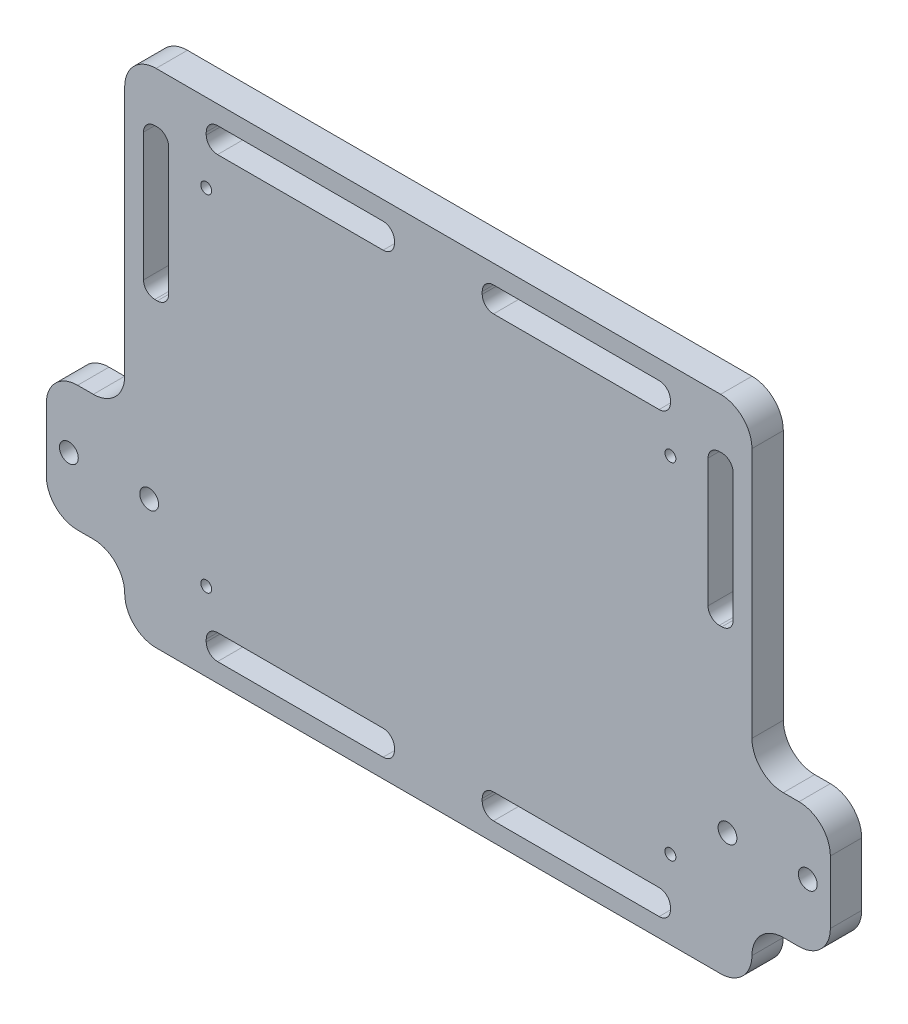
ISO-10303-21;
HEADER;
FILE_DESCRIPTION(('STEP AP214'),'2;1');
FILE_NAME('part.step','',(''),(''),'','','');
FILE_SCHEMA(('AUTOMOTIVE_DESIGN { 1 0 10303 214 1 1 1 1 }'));
ENDSEC;
DATA;
#1=APPLICATION_CONTEXT('core data for automotive mechanical design processes');
#2=APPLICATION_PROTOCOL_DEFINITION('international standard','automotive_design',2000,#1);
#3=PRODUCT_CONTEXT('',#1,'mechanical');
#4=PRODUCT('Part','Part','',(#3));
#5=PRODUCT_RELATED_PRODUCT_CATEGORY('part','',(#4));
#6=PRODUCT_DEFINITION_FORMATION('','',#4);
#7=PRODUCT_DEFINITION_CONTEXT('part definition',#1,'design');
#8=PRODUCT_DEFINITION('design','',#6,#7);
#9=PRODUCT_DEFINITION_SHAPE('','',#8);
#10=(LENGTH_UNIT() NAMED_UNIT(*) SI_UNIT(.MILLI.,.METRE.));
#11=(NAMED_UNIT(*) PLANE_ANGLE_UNIT() SI_UNIT($,.RADIAN.));
#12=(NAMED_UNIT(*) SI_UNIT($,.STERADIAN.) SOLID_ANGLE_UNIT());
#13=UNCERTAINTY_MEASURE_WITH_UNIT(LENGTH_MEASURE(1.E-05),#10,'distance_accuracy_value','');
#14=(GEOMETRIC_REPRESENTATION_CONTEXT(3) GLOBAL_UNCERTAINTY_ASSIGNED_CONTEXT((#13)) GLOBAL_UNIT_ASSIGNED_CONTEXT((#10,
#11,#12)) REPRESENTATION_CONTEXT('',''));
#15=CARTESIAN_POINT('',(0.,0.,0.));
#16=DIRECTION('',(0.,0.,1.));
#17=DIRECTION('',(1.,0.,0.));
#18=AXIS2_PLACEMENT_3D('',#15,#16,#17);
#19=CARTESIAN_POINT('',(63.5,50.8,6.35));
#20=DIRECTION('',(-1.,0.,0.));
#21=DIRECTION('',(0.,0.,1.));
#22=AXIS2_PLACEMENT_3D('',#19,#20,#21);
#23=PLANE('',#22);
#24=DIRECTION('',(0.,1.,0.));
#25=VECTOR('',#24,1.);
#26=CARTESIAN_POINT('',(63.5,50.8,6.35));
#27=LINE('',#26,#25);
#28=CARTESIAN_POINT('',(63.5,-6.34999999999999,6.35));
#29=VERTEX_POINT('',#28);
#30=CARTESIAN_POINT('',(63.5,44.45,6.35));
#31=VERTEX_POINT('',#30);
#32=EDGE_CURVE('E894',#29,#31,#27,.T.);
#33=ORIENTED_EDGE('',*,*,#32,.F.);
#34=DIRECTION('',(0.,0.,1.));
#35=VECTOR('',#34,1.);
#36=CARTESIAN_POINT('',(63.5,-6.34999999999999,0.));
#37=LINE('',#36,#35);
#38=CARTESIAN_POINT('',(63.5,-6.34999999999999,0.));
#39=VERTEX_POINT('',#38);
#40=EDGE_CURVE('E993',#29,#39,#37,.F.);
#41=ORIENTED_EDGE('',*,*,#40,.T.);
#42=DIRECTION('',(0.,1.,0.));
#43=VECTOR('',#42,1.);
#44=CARTESIAN_POINT('',(63.5,50.8,0.));
#45=LINE('',#44,#43);
#46=CARTESIAN_POINT('',(63.5,44.45,0.));
#47=VERTEX_POINT('',#46);
#48=EDGE_CURVE('E891',#39,#47,#45,.T.);
#49=ORIENTED_EDGE('',*,*,#48,.T.);
#50=DIRECTION('',(0.,0.,-1.));
#51=VECTOR('',#50,1.);
#52=CARTESIAN_POINT('',(63.5,44.45,6.35));
#53=LINE('',#52,#51);
#54=EDGE_CURVE('E944',#47,#31,#53,.F.);
#55=ORIENTED_EDGE('',*,*,#54,.T.);
#56=EDGE_LOOP('',(#33,#41,#49,#55));
#57=FACE_BOUND('',#56,.T.);
#58=ADVANCED_FACE('F32',(#57),#23,.F.);
#59=CARTESIAN_POINT('',(0.,0.,6.35));
#60=DIRECTION('',(0.,0.,1.));
#61=DIRECTION('',(1.,0.,0.));
#62=AXIS2_PLACEMENT_3D('',#59,#60,#61);
#63=PLANE('',#62);
#64=CARTESIAN_POINT('',(74.803,-25.4,6.35));
#65=DIRECTION('',(0.,0.,-1.));
#66=DIRECTION('',(-1.,0.,0.));
#67=AXIS2_PLACEMENT_3D('',#64,#65,#66);
#68=CIRCLE('',#67,1.90500000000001);
#69=CARTESIAN_POINT('',(72.898,-25.4,6.35));
#70=VERTEX_POINT('',#69);
#71=EDGE_CURVE('E1103',#70,#70,#68,.T.);
#72=ORIENTED_EDGE('',*,*,#71,.T.);
#73=EDGE_LOOP('',(#72));
#74=FACE_BOUND('',#73,.T.);
#75=CARTESIAN_POINT('',(58.547,-25.4,6.35));
#76=DIRECTION('',(0.,0.,-1.));
#77=DIRECTION('',(-1.,0.,0.));
#78=AXIS2_PLACEMENT_3D('',#75,#76,#77);
#79=CIRCLE('',#78,1.90500000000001);
#80=CARTESIAN_POINT('',(56.642,-25.4,6.35));
#81=VERTEX_POINT('',#80);
#82=EDGE_CURVE('E1097',#81,#81,#79,.T.);
#83=ORIENTED_EDGE('',*,*,#82,.T.);
#84=EDGE_LOOP('',(#83));
#85=FACE_BOUND('',#84,.T.);
#86=CARTESIAN_POINT('',(-74.803,-25.4,6.35));
#87=DIRECTION('',(0.,0.,1.));
#88=DIRECTION('',(1.,0.,0.));
#89=AXIS2_PLACEMENT_3D('',#86,#87,#88);
#90=CIRCLE('',#89,1.90500000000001);
#91=CARTESIAN_POINT('',(-72.898,-25.4,6.35));
#92=VERTEX_POINT('',#91);
#93=EDGE_CURVE('E1082',#92,#92,#90,.T.);
#94=ORIENTED_EDGE('',*,*,#93,.F.);
#95=EDGE_LOOP('',(#94));
#96=FACE_BOUND('',#95,.T.);
#97=CARTESIAN_POINT('',(-58.547,-25.4,6.35));
#98=DIRECTION('',(0.,0.,1.));
#99=DIRECTION('',(1.,0.,0.));
#100=AXIS2_PLACEMENT_3D('',#97,#98,#99);
#101=CIRCLE('',#100,1.90500000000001);
#102=CARTESIAN_POINT('',(-56.642,-25.4,6.35));
#103=VERTEX_POINT('',#102);
#104=EDGE_CURVE('E1075',#103,#103,#101,.T.);
#105=ORIENTED_EDGE('',*,*,#104,.F.);
#106=EDGE_LOOP('',(#105));
#107=FACE_BOUND('',#106,.T.);
#108=CARTESIAN_POINT('',(-56.896,12.446,6.35));
#109=DIRECTION('',(0.,0.,1.));
#110=DIRECTION('',(1.,0.,0.));
#111=AXIS2_PLACEMENT_3D('',#108,#109,#110);
#112=CIRCLE('',#111,2.286);
#113=CARTESIAN_POINT('',(-56.896,10.16,6.35));
#114=VERTEX_POINT('',#113);
#115=CARTESIAN_POINT('',(-54.61,12.446,6.35));
#116=VERTEX_POINT('',#115);
#117=EDGE_CURVE('E477',#114,#116,#112,.T.);
#118=ORIENTED_EDGE('',*,*,#117,.F.);
#119=DIRECTION('',(1.,0.,0.));
#120=VECTOR('',#119,1.);
#121=CARTESIAN_POINT('',(-57.404,10.16,6.35));
#122=LINE('',#121,#120);
#123=CARTESIAN_POINT('',(-57.404,10.16,6.35));
#124=VERTEX_POINT('',#123);
#125=EDGE_CURVE('E496',#124,#114,#122,.T.);
#126=ORIENTED_EDGE('',*,*,#125,.F.);
#127=CARTESIAN_POINT('',(-57.404,12.446,6.35));
#128=DIRECTION('',(0.,0.,1.));
#129=DIRECTION('',(1.,0.,0.));
#130=AXIS2_PLACEMENT_3D('',#127,#128,#129);
#131=CIRCLE('',#130,2.286);
#132=CARTESIAN_POINT('',(-59.69,12.446,6.35));
#133=VERTEX_POINT('',#132);
#134=EDGE_CURVE('E499',#133,#124,#131,.T.);
#135=ORIENTED_EDGE('',*,*,#134,.F.);
#136=DIRECTION('',(0.,-1.,0.));
#137=VECTOR('',#136,1.);
#138=CARTESIAN_POINT('',(-59.69,38.354,6.35));
#139=LINE('',#138,#137);
#140=CARTESIAN_POINT('',(-59.69,38.354,6.35));
#141=VERTEX_POINT('',#140);
#142=EDGE_CURVE('E531',#141,#133,#139,.T.);
#143=ORIENTED_EDGE('',*,*,#142,.F.);
#144=CARTESIAN_POINT('',(-57.404,38.354,6.35));
#145=DIRECTION('',(0.,0.,1.));
#146=DIRECTION('',(1.,0.,0.));
#147=AXIS2_PLACEMENT_3D('',#144,#145,#146);
#148=CIRCLE('',#147,2.286);
#149=CARTESIAN_POINT('',(-57.404,40.64,6.35));
#150=VERTEX_POINT('',#149);
#151=EDGE_CURVE('E528',#150,#141,#148,.T.);
#152=ORIENTED_EDGE('',*,*,#151,.F.);
#153=DIRECTION('',(-1.,0.,0.));
#154=VECTOR('',#153,1.);
#155=CARTESIAN_POINT('',(-57.404,40.64,6.35));
#156=LINE('',#155,#154);
#157=CARTESIAN_POINT('',(-56.896,40.64,6.35));
#158=VERTEX_POINT('',#157);
#159=EDGE_CURVE('E525',#158,#150,#156,.T.);
#160=ORIENTED_EDGE('',*,*,#159,.F.);
#161=CARTESIAN_POINT('',(-56.896,38.354,6.35));
#162=DIRECTION('',(0.,0.,1.));
#163=DIRECTION('',(-1.,0.,0.));
#164=AXIS2_PLACEMENT_3D('',#161,#162,#163);
#165=CIRCLE('',#164,2.286);
#166=CARTESIAN_POINT('',(-54.61,38.354,6.35));
#167=VERTEX_POINT('',#166);
#168=EDGE_CURVE('E522',#167,#158,#165,.T.);
#169=ORIENTED_EDGE('',*,*,#168,.F.);
#170=DIRECTION('',(0.,1.,0.));
#171=VECTOR('',#170,1.);
#172=CARTESIAN_POINT('',(-54.61,38.354,6.35));
#173=LINE('',#172,#171);
#174=EDGE_CURVE('E519',#116,#167,#173,.T.);
#175=ORIENTED_EDGE('',*,*,#174,.F.);
#176=EDGE_LOOP('',(#118,#126,#135,#143,#152,#160,#169,#175));
#177=FACE_BOUND('',#176,.T.);
#178=CARTESIAN_POINT('',(-11.176,44.196,6.35));
#179=DIRECTION('',(0.,0.,1.));
#180=DIRECTION('',(1.,0.,0.));
#181=AXIS2_PLACEMENT_3D('',#178,#179,#180);
#182=CIRCLE('',#181,2.286);
#183=CARTESIAN_POINT('',(-11.176,41.91,6.35));
#184=VERTEX_POINT('',#183);
#185=CARTESIAN_POINT('',(-8.89000000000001,44.196,6.35));
#186=VERTEX_POINT('',#185);
#187=EDGE_CURVE('E576',#184,#186,#182,.T.);
#188=ORIENTED_EDGE('',*,*,#187,.F.);
#189=DIRECTION('',(1.,0.,0.));
#190=VECTOR('',#189,1.);
#191=CARTESIAN_POINT('',(-44.704,41.91,6.35));
#192=LINE('',#191,#190);
#193=CARTESIAN_POINT('',(-44.704,41.91,6.35));
#194=VERTEX_POINT('',#193);
#195=EDGE_CURVE('E554',#194,#184,#192,.T.);
#196=ORIENTED_EDGE('',*,*,#195,.F.);
#197=CARTESIAN_POINT('',(-44.704,44.196,6.35));
#198=DIRECTION('',(0.,0.,1.));
#199=DIRECTION('',(1.,0.,0.));
#200=AXIS2_PLACEMENT_3D('',#197,#198,#199);
#201=CIRCLE('',#200,2.286);
#202=CARTESIAN_POINT('',(-46.99,44.196,6.35));
#203=VERTEX_POINT('',#202);
#204=EDGE_CURVE('E594',#203,#194,#201,.T.);
#205=ORIENTED_EDGE('',*,*,#204,.F.);
#206=DIRECTION('',(0.,-1.,0.));
#207=VECTOR('',#206,1.);
#208=CARTESIAN_POINT('',(-46.99,44.704,6.35));
#209=LINE('',#208,#207);
#210=CARTESIAN_POINT('',(-46.99,44.704,6.35));
#211=VERTEX_POINT('',#210);
#212=EDGE_CURVE('E591',#211,#203,#209,.T.);
#213=ORIENTED_EDGE('',*,*,#212,.F.);
#214=CARTESIAN_POINT('',(-44.704,44.704,6.35));
#215=DIRECTION('',(0.,0.,1.));
#216=DIRECTION('',(1.,0.,0.));
#217=AXIS2_PLACEMENT_3D('',#214,#215,#216);
#218=CIRCLE('',#217,2.286);
#219=CARTESIAN_POINT('',(-44.704,46.99,6.35));
#220=VERTEX_POINT('',#219);
#221=EDGE_CURVE('E588',#220,#211,#218,.T.);
#222=ORIENTED_EDGE('',*,*,#221,.F.);
#223=DIRECTION('',(-1.,0.,0.));
#224=VECTOR('',#223,1.);
#225=CARTESIAN_POINT('',(-44.704,46.99,6.35));
#226=LINE('',#225,#224);
#227=CARTESIAN_POINT('',(-11.176,46.99,6.35));
#228=VERTEX_POINT('',#227);
#229=EDGE_CURVE('E585',#228,#220,#226,.T.);
#230=ORIENTED_EDGE('',*,*,#229,.F.);
#231=CARTESIAN_POINT('',(-11.176,44.704,6.35));
#232=DIRECTION('',(0.,0.,1.));
#233=DIRECTION('',(-1.,0.,0.));
#234=AXIS2_PLACEMENT_3D('',#231,#232,#233);
#235=CIRCLE('',#234,2.286);
#236=CARTESIAN_POINT('',(-8.89,44.704,6.35));
#237=VERTEX_POINT('',#236);
#238=EDGE_CURVE('E582',#237,#228,#235,.T.);
#239=ORIENTED_EDGE('',*,*,#238,.F.);
#240=DIRECTION('',(0.,1.,0.));
#241=VECTOR('',#240,1.);
#242=CARTESIAN_POINT('',(-8.89000000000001,44.704,6.35));
#243=LINE('',#242,#241);
#244=EDGE_CURVE('E578',#186,#237,#243,.T.);
#245=ORIENTED_EDGE('',*,*,#244,.F.);
#246=EDGE_LOOP('',(#188,#196,#205,#213,#222,#230,#239,#245));
#247=FACE_BOUND('',#246,.T.);
#248=CARTESIAN_POINT('',(-44.704,-44.704,6.35));
#249=DIRECTION('',(0.,0.,1.));
#250=DIRECTION('',(-1.,0.,0.));
#251=AXIS2_PLACEMENT_3D('',#248,#249,#250);
#252=CIRCLE('',#251,2.286);
#253=CARTESIAN_POINT('',(-46.99,-44.704,6.35));
#254=VERTEX_POINT('',#253);
#255=CARTESIAN_POINT('',(-44.704,-46.99,6.35));
#256=VERTEX_POINT('',#255);
#257=EDGE_CURVE('E640',#254,#256,#252,.T.);
#258=ORIENTED_EDGE('',*,*,#257,.F.);
#259=DIRECTION('',(0.,-1.,0.));
#260=VECTOR('',#259,1.);
#261=CARTESIAN_POINT('',(-46.99,-44.704,6.35));
#262=LINE('',#261,#260);
#263=CARTESIAN_POINT('',(-46.99,-44.196,6.35));
#264=VERTEX_POINT('',#263);
#265=EDGE_CURVE('E618',#264,#254,#262,.T.);
#266=ORIENTED_EDGE('',*,*,#265,.F.);
#267=CARTESIAN_POINT('',(-44.704,-44.196,6.35));
#268=DIRECTION('',(0.,0.,1.));
#269=DIRECTION('',(-1.,0.,0.));
#270=AXIS2_PLACEMENT_3D('',#267,#268,#269);
#271=CIRCLE('',#270,2.286);
#272=CARTESIAN_POINT('',(-44.704,-41.91,6.35));
#273=VERTEX_POINT('',#272);
#274=EDGE_CURVE('E658',#273,#264,#271,.T.);
#275=ORIENTED_EDGE('',*,*,#274,.F.);
#276=DIRECTION('',(-1.,0.,0.));
#277=VECTOR('',#276,1.);
#278=CARTESIAN_POINT('',(-44.704,-41.91,6.35));
#279=LINE('',#278,#277);
#280=CARTESIAN_POINT('',(-11.176,-41.91,6.35));
#281=VERTEX_POINT('',#280);
#282=EDGE_CURVE('E655',#281,#273,#279,.T.);
#283=ORIENTED_EDGE('',*,*,#282,.F.);
#284=CARTESIAN_POINT('',(-11.176,-44.196,6.35));
#285=DIRECTION('',(0.,0.,1.));
#286=DIRECTION('',(-1.,0.,0.));
#287=AXIS2_PLACEMENT_3D('',#284,#285,#286);
#288=CIRCLE('',#287,2.286);
#289=CARTESIAN_POINT('',(-8.89000000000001,-44.196,6.35));
#290=VERTEX_POINT('',#289);
#291=EDGE_CURVE('E652',#290,#281,#288,.T.);
#292=ORIENTED_EDGE('',*,*,#291,.F.);
#293=DIRECTION('',(0.,1.,0.));
#294=VECTOR('',#293,1.);
#295=CARTESIAN_POINT('',(-8.89000000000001,-44.704,6.35));
#296=LINE('',#295,#294);
#297=CARTESIAN_POINT('',(-8.89,-44.704,6.35));
#298=VERTEX_POINT('',#297);
#299=EDGE_CURVE('E649',#298,#290,#296,.T.);
#300=ORIENTED_EDGE('',*,*,#299,.F.);
#301=CARTESIAN_POINT('',(-11.176,-44.704,6.35));
#302=DIRECTION('',(0.,0.,1.));
#303=DIRECTION('',(1.,0.,0.));
#304=AXIS2_PLACEMENT_3D('',#301,#302,#303);
#305=CIRCLE('',#304,2.286);
#306=CARTESIAN_POINT('',(-11.176,-46.99,6.35));
#307=VERTEX_POINT('',#306);
#308=EDGE_CURVE('E646',#307,#298,#305,.T.);
#309=ORIENTED_EDGE('',*,*,#308,.F.);
#310=DIRECTION('',(1.,0.,0.));
#311=VECTOR('',#310,1.);
#312=CARTESIAN_POINT('',(-44.704,-46.99,6.35));
#313=LINE('',#312,#311);
#314=EDGE_CURVE('E642',#256,#307,#313,.T.);
#315=ORIENTED_EDGE('',*,*,#314,.F.);
#316=EDGE_LOOP('',(#258,#266,#275,#283,#292,#300,#309,#315));
#317=FACE_BOUND('',#316,.T.);
#318=CARTESIAN_POINT('',(11.176,-44.196,6.35));
#319=DIRECTION('',(0.,0.,1.));
#320=DIRECTION('',(1.,0.,0.));
#321=AXIS2_PLACEMENT_3D('',#318,#319,#320);
#322=CIRCLE('',#321,2.286);
#323=CARTESIAN_POINT('',(11.176,-41.91,6.35));
#324=VERTEX_POINT('',#323);
#325=CARTESIAN_POINT('',(8.89000000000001,-44.196,6.35));
#326=VERTEX_POINT('',#325);
#327=EDGE_CURVE('E704',#324,#326,#322,.T.);
#328=ORIENTED_EDGE('',*,*,#327,.F.);
#329=DIRECTION('',(-1.,0.,0.));
#330=VECTOR('',#329,1.);
#331=CARTESIAN_POINT('',(44.704,-41.91,6.35));
#332=LINE('',#331,#330);
#333=CARTESIAN_POINT('',(44.704,-41.91,6.35));
#334=VERTEX_POINT('',#333);
#335=EDGE_CURVE('E682',#334,#324,#332,.T.);
#336=ORIENTED_EDGE('',*,*,#335,.F.);
#337=CARTESIAN_POINT('',(44.704,-44.196,6.35));
#338=DIRECTION('',(0.,0.,1.));
#339=DIRECTION('',(1.,0.,0.));
#340=AXIS2_PLACEMENT_3D('',#337,#338,#339);
#341=CIRCLE('',#340,2.286);
#342=CARTESIAN_POINT('',(46.99,-44.196,6.35));
#343=VERTEX_POINT('',#342);
#344=EDGE_CURVE('E722',#343,#334,#341,.T.);
#345=ORIENTED_EDGE('',*,*,#344,.F.);
#346=DIRECTION('',(0.,1.,0.));
#347=VECTOR('',#346,1.);
#348=CARTESIAN_POINT('',(46.99,-44.704,6.35));
#349=LINE('',#348,#347);
#350=CARTESIAN_POINT('',(46.99,-44.704,6.35));
#351=VERTEX_POINT('',#350);
#352=EDGE_CURVE('E719',#351,#343,#349,.T.);
#353=ORIENTED_EDGE('',*,*,#352,.F.);
#354=CARTESIAN_POINT('',(44.704,-44.704,6.35));
#355=DIRECTION('',(0.,0.,1.));
#356=DIRECTION('',(1.,0.,0.));
#357=AXIS2_PLACEMENT_3D('',#354,#355,#356);
#358=CIRCLE('',#357,2.286);
#359=CARTESIAN_POINT('',(44.704,-46.99,6.35));
#360=VERTEX_POINT('',#359);
#361=EDGE_CURVE('E716',#360,#351,#358,.T.);
#362=ORIENTED_EDGE('',*,*,#361,.F.);
#363=DIRECTION('',(1.,0.,0.));
#364=VECTOR('',#363,1.);
#365=CARTESIAN_POINT('',(44.704,-46.99,6.35));
#366=LINE('',#365,#364);
#367=CARTESIAN_POINT('',(11.176,-46.99,6.35));
#368=VERTEX_POINT('',#367);
#369=EDGE_CURVE('E713',#368,#360,#366,.T.);
#370=ORIENTED_EDGE('',*,*,#369,.F.);
#371=CARTESIAN_POINT('',(11.176,-44.704,6.35));
#372=DIRECTION('',(0.,0.,1.));
#373=DIRECTION('',(-1.,0.,0.));
#374=AXIS2_PLACEMENT_3D('',#371,#372,#373);
#375=CIRCLE('',#374,2.286);
#376=CARTESIAN_POINT('',(8.89,-44.704,6.35));
#377=VERTEX_POINT('',#376);
#378=EDGE_CURVE('E710',#377,#368,#375,.T.);
#379=ORIENTED_EDGE('',*,*,#378,.F.);
#380=DIRECTION('',(0.,-1.,0.));
#381=VECTOR('',#380,1.);
#382=CARTESIAN_POINT('',(8.89000000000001,-44.704,6.35));
#383=LINE('',#382,#381);
#384=EDGE_CURVE('E706',#326,#377,#383,.T.);
#385=ORIENTED_EDGE('',*,*,#384,.F.);
#386=EDGE_LOOP('',(#328,#336,#345,#353,#362,#370,#379,#385));
#387=FACE_BOUND('',#386,.T.);
#388=CARTESIAN_POINT('',(44.704,44.704,6.35));
#389=DIRECTION('',(0.,0.,1.));
#390=DIRECTION('',(-1.,0.,0.));
#391=AXIS2_PLACEMENT_3D('',#388,#389,#390);
#392=CIRCLE('',#391,2.286);
#393=CARTESIAN_POINT('',(46.99,44.704,6.35));
#394=VERTEX_POINT('',#393);
#395=CARTESIAN_POINT('',(44.704,46.99,6.35));
#396=VERTEX_POINT('',#395);
#397=EDGE_CURVE('E768',#394,#396,#392,.T.);
#398=ORIENTED_EDGE('',*,*,#397,.F.);
#399=DIRECTION('',(0.,1.,0.));
#400=VECTOR('',#399,1.);
#401=CARTESIAN_POINT('',(46.99,44.704,6.35));
#402=LINE('',#401,#400);
#403=CARTESIAN_POINT('',(46.99,44.196,6.35));
#404=VERTEX_POINT('',#403);
#405=EDGE_CURVE('E746',#404,#394,#402,.T.);
#406=ORIENTED_EDGE('',*,*,#405,.F.);
#407=CARTESIAN_POINT('',(44.704,44.196,6.35));
#408=DIRECTION('',(0.,0.,1.));
#409=DIRECTION('',(-1.,0.,0.));
#410=AXIS2_PLACEMENT_3D('',#407,#408,#409);
#411=CIRCLE('',#410,2.286);
#412=CARTESIAN_POINT('',(44.704,41.91,6.35));
#413=VERTEX_POINT('',#412);
#414=EDGE_CURVE('E786',#413,#404,#411,.T.);
#415=ORIENTED_EDGE('',*,*,#414,.F.);
#416=DIRECTION('',(1.,0.,0.));
#417=VECTOR('',#416,1.);
#418=CARTESIAN_POINT('',(44.704,41.91,6.35));
#419=LINE('',#418,#417);
#420=CARTESIAN_POINT('',(11.176,41.91,6.35));
#421=VERTEX_POINT('',#420);
#422=EDGE_CURVE('E783',#421,#413,#419,.T.);
#423=ORIENTED_EDGE('',*,*,#422,.F.);
#424=CARTESIAN_POINT('',(11.176,44.196,6.35));
#425=DIRECTION('',(0.,0.,1.));
#426=DIRECTION('',(-1.,0.,0.));
#427=AXIS2_PLACEMENT_3D('',#424,#425,#426);
#428=CIRCLE('',#427,2.286);
#429=CARTESIAN_POINT('',(8.89000000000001,44.196,6.35));
#430=VERTEX_POINT('',#429);
#431=EDGE_CURVE('E780',#430,#421,#428,.T.);
#432=ORIENTED_EDGE('',*,*,#431,.F.);
#433=DIRECTION('',(0.,-1.,0.));
#434=VECTOR('',#433,1.);
#435=CARTESIAN_POINT('',(8.89000000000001,44.704,6.35));
#436=LINE('',#435,#434);
#437=CARTESIAN_POINT('',(8.89,44.704,6.35));
#438=VERTEX_POINT('',#437);
#439=EDGE_CURVE('E777',#438,#430,#436,.T.);
#440=ORIENTED_EDGE('',*,*,#439,.F.);
#441=CARTESIAN_POINT('',(11.176,44.704,6.35));
#442=DIRECTION('',(0.,0.,1.));
#443=DIRECTION('',(1.,0.,0.));
#444=AXIS2_PLACEMENT_3D('',#441,#442,#443);
#445=CIRCLE('',#444,2.286);
#446=CARTESIAN_POINT('',(11.176,46.99,6.35));
#447=VERTEX_POINT('',#446);
#448=EDGE_CURVE('E774',#447,#438,#445,.T.);
#449=ORIENTED_EDGE('',*,*,#448,.F.);
#450=DIRECTION('',(-1.,0.,0.));
#451=VECTOR('',#450,1.);
#452=CARTESIAN_POINT('',(44.704,46.99,6.35));
#453=LINE('',#452,#451);
#454=EDGE_CURVE('E770',#396,#447,#453,.T.);
#455=ORIENTED_EDGE('',*,*,#454,.F.);
#456=EDGE_LOOP('',(#398,#406,#415,#423,#432,#440,#449,#455));
#457=FACE_BOUND('',#456,.T.);
#458=CARTESIAN_POINT('',(56.896,38.354,6.35));
#459=DIRECTION('',(0.,0.,1.));
#460=DIRECTION('',(1.,0.,0.));
#461=AXIS2_PLACEMENT_3D('',#458,#459,#460);
#462=CIRCLE('',#461,2.286);
#463=CARTESIAN_POINT('',(56.896,40.64,6.35));
#464=VERTEX_POINT('',#463);
#465=CARTESIAN_POINT('',(54.61,38.354,6.35));
#466=VERTEX_POINT('',#465);
#467=EDGE_CURVE('E832',#464,#466,#462,.T.);
#468=ORIENTED_EDGE('',*,*,#467,.F.);
#469=DIRECTION('',(-1.,0.,0.));
#470=VECTOR('',#469,1.);
#471=CARTESIAN_POINT('',(57.404,40.64,6.35));
#472=LINE('',#471,#470);
#473=CARTESIAN_POINT('',(57.404,40.64,6.35));
#474=VERTEX_POINT('',#473);
#475=EDGE_CURVE('E810',#474,#464,#472,.T.);
#476=ORIENTED_EDGE('',*,*,#475,.F.);
#477=CARTESIAN_POINT('',(57.404,38.354,6.35));
#478=DIRECTION('',(0.,0.,1.));
#479=DIRECTION('',(-1.,0.,0.));
#480=AXIS2_PLACEMENT_3D('',#477,#478,#479);
#481=CIRCLE('',#480,2.286);
#482=CARTESIAN_POINT('',(59.69,38.354,6.35));
#483=VERTEX_POINT('',#482);
#484=EDGE_CURVE('E850',#483,#474,#481,.T.);
#485=ORIENTED_EDGE('',*,*,#484,.F.);
#486=DIRECTION('',(0.,1.,0.));
#487=VECTOR('',#486,1.);
#488=CARTESIAN_POINT('',(59.69,38.354,6.35));
#489=LINE('',#488,#487);
#490=CARTESIAN_POINT('',(59.69,12.446,6.35));
#491=VERTEX_POINT('',#490);
#492=EDGE_CURVE('E847',#491,#483,#489,.T.);
#493=ORIENTED_EDGE('',*,*,#492,.F.);
#494=CARTESIAN_POINT('',(57.404,12.446,6.35));
#495=DIRECTION('',(0.,0.,1.));
#496=DIRECTION('',(-1.,0.,0.));
#497=AXIS2_PLACEMENT_3D('',#494,#495,#496);
#498=CIRCLE('',#497,2.286);
#499=CARTESIAN_POINT('',(57.404,10.16,6.35));
#500=VERTEX_POINT('',#499);
#501=EDGE_CURVE('E844',#500,#491,#498,.T.);
#502=ORIENTED_EDGE('',*,*,#501,.F.);
#503=DIRECTION('',(1.,0.,0.));
#504=VECTOR('',#503,1.);
#505=CARTESIAN_POINT('',(57.404,10.16,6.35));
#506=LINE('',#505,#504);
#507=CARTESIAN_POINT('',(56.896,10.16,6.35));
#508=VERTEX_POINT('',#507);
#509=EDGE_CURVE('E841',#508,#500,#506,.T.);
#510=ORIENTED_EDGE('',*,*,#509,.F.);
#511=CARTESIAN_POINT('',(56.896,12.446,6.35));
#512=DIRECTION('',(0.,0.,1.));
#513=DIRECTION('',(-1.,0.,0.));
#514=AXIS2_PLACEMENT_3D('',#511,#512,#513);
#515=CIRCLE('',#514,2.286);
#516=CARTESIAN_POINT('',(54.61,12.446,6.35));
#517=VERTEX_POINT('',#516);
#518=EDGE_CURVE('E838',#517,#508,#515,.T.);
#519=ORIENTED_EDGE('',*,*,#518,.F.);
#520=DIRECTION('',(0.,-1.,0.));
#521=VECTOR('',#520,1.);
#522=CARTESIAN_POINT('',(54.61,38.354,6.35));
#523=LINE('',#522,#521);
#524=EDGE_CURVE('E834',#466,#517,#523,.T.);
#525=ORIENTED_EDGE('',*,*,#524,.F.);
#526=EDGE_LOOP('',(#468,#476,#485,#493,#502,#510,#519,#525));
#527=FACE_BOUND('',#526,.T.);
#528=CARTESIAN_POINT('',(46.99,-34.925,6.35));
#529=DIRECTION('',(0.,0.,1.));
#530=DIRECTION('',(1.,0.,0.));
#531=AXIS2_PLACEMENT_3D('',#528,#529,#530);
#532=CIRCLE('',#531,1.1049);
#533=CARTESIAN_POINT('',(48.0949,-34.925,6.35));
#534=VERTEX_POINT('',#533);
#535=EDGE_CURVE('E876',#534,#534,#532,.T.);
#536=ORIENTED_EDGE('',*,*,#535,.F.);
#537=EDGE_LOOP('',(#536));
#538=FACE_BOUND('',#537,.T.);
#539=CARTESIAN_POINT('',(-46.99,34.925,6.35));
#540=DIRECTION('',(0.,0.,1.));
#541=DIRECTION('',(1.,0.,0.));
#542=AXIS2_PLACEMENT_3D('',#539,#540,#541);
#543=CIRCLE('',#542,1.1049);
#544=CARTESIAN_POINT('',(-45.8851,34.925,6.35));
#545=VERTEX_POINT('',#544);
#546=EDGE_CURVE('E888',#545,#545,#543,.T.);
#547=ORIENTED_EDGE('',*,*,#546,.F.);
#548=EDGE_LOOP('',(#547));
#549=FACE_BOUND('',#548,.T.);
#550=DIRECTION('',(0.,-1.,0.));
#551=VECTOR('',#550,1.);
#552=CARTESIAN_POINT('',(-79.375,-12.7,6.35));
#553=LINE('',#552,#551);
#554=CARTESIAN_POINT('',(-79.375,-19.05,6.35));
#555=VERTEX_POINT('',#554);
#556=CARTESIAN_POINT('',(-79.375,-31.75,6.35));
#557=VERTEX_POINT('',#556);
#558=EDGE_CURVE('E1067',#555,#557,#553,.T.);
#559=ORIENTED_EDGE('',*,*,#558,.T.);
#560=CARTESIAN_POINT('',(-73.025,-31.75,6.35));
#561=DIRECTION('',(0.,0.,1.));
#562=DIRECTION('',(1.,0.,0.));
#563=AXIS2_PLACEMENT_3D('',#560,#561,#562);
#564=CIRCLE('',#563,6.35);
#565=CARTESIAN_POINT('',(-73.025,-38.1,6.35));
#566=VERTEX_POINT('',#565);
#567=EDGE_CURVE('E966',#557,#566,#564,.T.);
#568=ORIENTED_EDGE('',*,*,#567,.T.);
#569=DIRECTION('',(1.,0.,0.));
#570=VECTOR('',#569,1.);
#571=CARTESIAN_POINT('',(-63.5,-38.1,6.35));
#572=LINE('',#571,#570);
#573=CARTESIAN_POINT('',(-69.85,-38.1,6.35));
#574=VERTEX_POINT('',#573);
#575=EDGE_CURVE('E502',#566,#574,#572,.T.);
#576=ORIENTED_EDGE('',*,*,#575,.T.);
#577=CARTESIAN_POINT('',(-69.85,-44.45,6.35));
#578=DIRECTION('',(0.,0.,1.));
#579=DIRECTION('',(1.,0.,0.));
#580=AXIS2_PLACEMENT_3D('',#577,#578,#579);
#581=CIRCLE('',#580,6.35);
#582=CARTESIAN_POINT('',(-63.5,-44.45,6.35));
#583=VERTEX_POINT('',#582);
#584=EDGE_CURVE('E1004',#574,#583,#581,.F.);
#585=ORIENTED_EDGE('',*,*,#584,.T.);
#586=CARTESIAN_POINT('',(-57.15,-44.45,6.35));
#587=DIRECTION('',(0.,0.,1.));
#588=DIRECTION('',(1.,0.,0.));
#589=AXIS2_PLACEMENT_3D('',#586,#587,#588);
#590=CIRCLE('',#589,6.35);
#591=CARTESIAN_POINT('',(-57.15,-50.8,6.35));
#592=VERTEX_POINT('',#591);
#593=EDGE_CURVE('E942',#583,#592,#590,.T.);
#594=ORIENTED_EDGE('',*,*,#593,.T.);
#595=DIRECTION('',(1.,0.,0.));
#596=VECTOR('',#595,1.);
#597=CARTESIAN_POINT('',(-63.5,-50.8,6.35));
#598=LINE('',#597,#596);
#599=CARTESIAN_POINT('',(57.15,-50.8,6.35));
#600=VERTEX_POINT('',#599);
#601=EDGE_CURVE('E903',#592,#600,#598,.T.);
#602=ORIENTED_EDGE('',*,*,#601,.T.);
#603=CARTESIAN_POINT('',(57.15,-44.45,6.35));
#604=DIRECTION('',(0.,0.,1.));
#605=DIRECTION('',(1.,0.,0.));
#606=AXIS2_PLACEMENT_3D('',#603,#604,#605);
#607=CIRCLE('',#606,6.35);
#608=CARTESIAN_POINT('',(63.5,-44.45,6.35));
#609=VERTEX_POINT('',#608);
#610=EDGE_CURVE('E939',#600,#609,#607,.T.);
#611=ORIENTED_EDGE('',*,*,#610,.T.);
#612=CARTESIAN_POINT('',(69.85,-44.45,6.35));
#613=DIRECTION('',(0.,0.,1.));
#614=DIRECTION('',(1.,0.,0.));
#615=AXIS2_PLACEMENT_3D('',#612,#613,#614);
#616=CIRCLE('',#615,6.35);
#617=CARTESIAN_POINT('',(69.85,-38.1,6.35));
#618=VERTEX_POINT('',#617);
#619=EDGE_CURVE('E40',#609,#618,#616,.F.);
#620=ORIENTED_EDGE('',*,*,#619,.T.);
#621=DIRECTION('',(-1.,0.,0.));
#622=VECTOR('',#621,1.);
#623=CARTESIAN_POINT('',(63.5,-38.1,6.35));
#624=LINE('',#623,#622);
#625=CARTESIAN_POINT('',(73.025,-38.1,6.35));
#626=VERTEX_POINT('',#625);
#627=EDGE_CURVE('E1020',#626,#618,#624,.T.);
#628=ORIENTED_EDGE('',*,*,#627,.F.);
#629=CARTESIAN_POINT('',(73.025,-31.75,6.35));
#630=DIRECTION('',(0.,0.,1.));
#631=DIRECTION('',(1.,0.,0.));
#632=AXIS2_PLACEMENT_3D('',#629,#630,#631);
#633=CIRCLE('',#632,6.35);
#634=CARTESIAN_POINT('',(79.375,-31.75,6.35));
#635=VERTEX_POINT('',#634);
#636=EDGE_CURVE('E962',#626,#635,#633,.T.);
#637=ORIENTED_EDGE('',*,*,#636,.T.);
#638=DIRECTION('',(0.,-1.,0.));
#639=VECTOR('',#638,1.);
#640=CARTESIAN_POINT('',(79.375,-12.7,6.35));
#641=LINE('',#640,#639);
#642=CARTESIAN_POINT('',(79.375,-19.05,6.35));
#643=VERTEX_POINT('',#642);
#644=EDGE_CURVE('E1026',#643,#635,#641,.T.);
#645=ORIENTED_EDGE('',*,*,#644,.F.);
#646=CARTESIAN_POINT('',(73.025,-19.05,6.35));
#647=DIRECTION('',(0.,0.,1.));
#648=DIRECTION('',(1.,0.,0.));
#649=AXIS2_PLACEMENT_3D('',#646,#647,#648);
#650=CIRCLE('',#649,6.35);
#651=CARTESIAN_POINT('',(73.025,-12.7,6.35));
#652=VERTEX_POINT('',#651);
#653=EDGE_CURVE('E960',#643,#652,#650,.T.);
#654=ORIENTED_EDGE('',*,*,#653,.T.);
#655=DIRECTION('',(1.,0.,0.));
#656=VECTOR('',#655,1.);
#657=CARTESIAN_POINT('',(63.5,-12.7,6.35));
#658=LINE('',#657,#656);
#659=CARTESIAN_POINT('',(69.85,-12.7,6.35));
#660=VERTEX_POINT('',#659);
#661=EDGE_CURVE('E1087',#660,#652,#658,.T.);
#662=ORIENTED_EDGE('',*,*,#661,.F.);
#663=CARTESIAN_POINT('',(69.85,-6.34999999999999,6.35));
#664=DIRECTION('',(0.,0.,1.));
#665=DIRECTION('',(1.,0.,0.));
#666=AXIS2_PLACEMENT_3D('',#663,#664,#665);
#667=CIRCLE('',#666,6.35);
#668=EDGE_CURVE('E1012',#660,#29,#667,.F.);
#669=ORIENTED_EDGE('',*,*,#668,.T.);
#670=ORIENTED_EDGE('',*,*,#32,.T.);
#671=CARTESIAN_POINT('',(57.15,44.45,6.35));
#672=DIRECTION('',(0.,0.,1.));
#673=DIRECTION('',(1.,0.,0.));
#674=AXIS2_PLACEMENT_3D('',#671,#672,#673);
#675=CIRCLE('',#674,6.35);
#676=CARTESIAN_POINT('',(57.15,50.8,6.35));
#677=VERTEX_POINT('',#676);
#678=EDGE_CURVE('E937',#31,#677,#675,.T.);
#679=ORIENTED_EDGE('',*,*,#678,.T.);
#680=DIRECTION('',(-1.,0.,0.));
#681=VECTOR('',#680,1.);
#682=CARTESIAN_POINT('',(-63.5,50.8,6.35));
#683=LINE('',#682,#681);
#684=CARTESIAN_POINT('',(-57.15,50.8,6.35));
#685=VERTEX_POINT('',#684);
#686=EDGE_CURVE('E896',#677,#685,#683,.T.);
#687=ORIENTED_EDGE('',*,*,#686,.T.);
#688=CARTESIAN_POINT('',(-57.15,44.45,6.35));
#689=DIRECTION('',(0.,0.,1.));
#690=DIRECTION('',(1.,0.,0.));
#691=AXIS2_PLACEMENT_3D('',#688,#689,#690);
#692=CIRCLE('',#691,6.35);
#693=CARTESIAN_POINT('',(-63.5,44.45,6.35));
#694=VERTEX_POINT('',#693);
#695=EDGE_CURVE('E935',#685,#694,#692,.T.);
#696=ORIENTED_EDGE('',*,*,#695,.T.);
#697=DIRECTION('',(0.,-1.,0.));
#698=VECTOR('',#697,1.);
#699=CARTESIAN_POINT('',(-63.5,50.8,6.35));
#700=LINE('',#699,#698);
#701=CARTESIAN_POINT('',(-63.5,-6.34999999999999,6.35));
#702=VERTEX_POINT('',#701);
#703=EDGE_CURVE('E900',#694,#702,#700,.T.);
#704=ORIENTED_EDGE('',*,*,#703,.T.);
#705=CARTESIAN_POINT('',(-69.85,-6.34999999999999,6.35));
#706=DIRECTION('',(0.,0.,1.));
#707=DIRECTION('',(1.,0.,0.));
#708=AXIS2_PLACEMENT_3D('',#705,#706,#707);
#709=CIRCLE('',#708,6.35);
#710=CARTESIAN_POINT('',(-69.85,-12.7,6.35));
#711=VERTEX_POINT('',#710);
#712=EDGE_CURVE('E1008',#702,#711,#709,.F.);
#713=ORIENTED_EDGE('',*,*,#712,.T.);
#714=DIRECTION('',(-1.,0.,0.));
#715=VECTOR('',#714,1.);
#716=CARTESIAN_POINT('',(-63.5,-12.7,6.35));
#717=LINE('',#716,#715);
#718=CARTESIAN_POINT('',(-73.025,-12.7,6.35));
#719=VERTEX_POINT('',#718);
#720=EDGE_CURVE('E1065',#711,#719,#717,.T.);
#721=ORIENTED_EDGE('',*,*,#720,.T.);
#722=CARTESIAN_POINT('',(-73.025,-19.05,6.35));
#723=DIRECTION('',(0.,0.,1.));
#724=DIRECTION('',(1.,0.,0.));
#725=AXIS2_PLACEMENT_3D('',#722,#723,#724);
#726=CIRCLE('',#725,6.35);
#727=EDGE_CURVE('E964',#719,#555,#726,.T.);
#728=ORIENTED_EDGE('',*,*,#727,.T.);
#729=EDGE_LOOP('',(#559,#568,#576,#585,#594,#602,#611,#620,#628,#637,#645,#654,#662,#669,#670,
#679,#687,#696,#704,#713,#721,#728));
#730=FACE_BOUND('',#729,.T.);
#731=CARTESIAN_POINT('',(-46.99,-34.925,6.35));
#732=DIRECTION('',(0.,0.,1.));
#733=DIRECTION('',(-1.,0.,0.));
#734=AXIS2_PLACEMENT_3D('',#731,#732,#733);
#735=CIRCLE('',#734,1.1049);
#736=CARTESIAN_POINT('',(-48.0949,-34.925,6.35));
#737=VERTEX_POINT('',#736);
#738=EDGE_CURVE('E882',#737,#737,#735,.T.);
#739=ORIENTED_EDGE('',*,*,#738,.F.);
#740=EDGE_LOOP('',(#739));
#741=FACE_BOUND('',#740,.T.);
#742=CARTESIAN_POINT('',(46.99,34.9249999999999,6.35));
#743=DIRECTION('',(0.,0.,1.));
#744=DIRECTION('',(-1.,0.,0.));
#745=AXIS2_PLACEMENT_3D('',#742,#743,#744);
#746=CIRCLE('',#745,1.1049);
#747=CARTESIAN_POINT('',(45.8851,34.9249999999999,6.35));
#748=VERTEX_POINT('',#747);
#749=EDGE_CURVE('E870',#748,#748,#746,.T.);
#750=ORIENTED_EDGE('',*,*,#749,.F.);
#751=EDGE_LOOP('',(#750));
#752=FACE_BOUND('',#751,.T.);
#753=ADVANCED_FACE('F1018',(#74,#85,#96,#107,#177,#247,#317,#387,#457,#527,#538,#549,#730,#741,
#752),#63,.T.);
#754=CARTESIAN_POINT('',(0.,0.,0.));
#755=DIRECTION('',(0.,0.,1.));
#756=DIRECTION('',(1.,0.,0.));
#757=AXIS2_PLACEMENT_3D('',#754,#755,#756);
#758=PLANE('',#757);
#759=CARTESIAN_POINT('',(74.803,-25.4,0.));
#760=DIRECTION('',(0.,0.,-1.));
#761=DIRECTION('',(-1.,0.,0.));
#762=AXIS2_PLACEMENT_3D('',#759,#760,#761);
#763=CIRCLE('',#762,1.90500000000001);
#764=CARTESIAN_POINT('',(72.898,-25.4,0.));
#765=VERTEX_POINT('',#764);
#766=EDGE_CURVE('E1027',#765,#765,#763,.T.);
#767=ORIENTED_EDGE('',*,*,#766,.F.);
#768=EDGE_LOOP('',(#767));
#769=FACE_BOUND('',#768,.T.);
#770=CARTESIAN_POINT('',(58.547,-25.4,0.));
#771=DIRECTION('',(0.,0.,-1.));
#772=DIRECTION('',(-1.,0.,0.));
#773=AXIS2_PLACEMENT_3D('',#770,#771,#772);
#774=CIRCLE('',#773,1.90500000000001);
#775=CARTESIAN_POINT('',(56.642,-25.4,0.));
#776=VERTEX_POINT('',#775);
#777=EDGE_CURVE('E1100',#776,#776,#774,.T.);
#778=ORIENTED_EDGE('',*,*,#777,.F.);
#779=EDGE_LOOP('',(#778));
#780=FACE_BOUND('',#779,.T.);
#781=CARTESIAN_POINT('',(-74.803,-25.4,0.));
#782=DIRECTION('',(0.,0.,1.));
#783=DIRECTION('',(1.,0.,0.));
#784=AXIS2_PLACEMENT_3D('',#781,#782,#783);
#785=CIRCLE('',#784,1.90500000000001);
#786=CARTESIAN_POINT('',(-72.898,-25.4,0.));
#787=VERTEX_POINT('',#786);
#788=EDGE_CURVE('E1068',#787,#787,#785,.T.);
#789=ORIENTED_EDGE('',*,*,#788,.T.);
#790=EDGE_LOOP('',(#789));
#791=FACE_BOUND('',#790,.T.);
#792=CARTESIAN_POINT('',(-58.547,-25.4,0.));
#793=DIRECTION('',(0.,0.,1.));
#794=DIRECTION('',(1.,0.,0.));
#795=AXIS2_PLACEMENT_3D('',#792,#793,#794);
#796=CIRCLE('',#795,1.90500000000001);
#797=CARTESIAN_POINT('',(-56.642,-25.4,0.));
#798=VERTEX_POINT('',#797);
#799=EDGE_CURVE('E1078',#798,#798,#796,.T.);
#800=ORIENTED_EDGE('',*,*,#799,.T.);
#801=EDGE_LOOP('',(#800));
#802=FACE_BOUND('',#801,.T.);
#803=DIRECTION('',(1.,0.,0.));
#804=VECTOR('',#803,1.);
#805=CARTESIAN_POINT('',(-57.404,10.16,0.));
#806=LINE('',#805,#804);
#807=CARTESIAN_POINT('',(-57.404,10.16,0.));
#808=VERTEX_POINT('',#807);
#809=CARTESIAN_POINT('',(-56.896,10.16,0.));
#810=VERTEX_POINT('',#809);
#811=EDGE_CURVE('E482',#808,#810,#806,.T.);
#812=ORIENTED_EDGE('',*,*,#811,.T.);
#813=CARTESIAN_POINT('',(-56.896,12.446,0.));
#814=DIRECTION('',(0.,0.,1.));
#815=DIRECTION('',(1.,0.,0.));
#816=AXIS2_PLACEMENT_3D('',#813,#814,#815);
#817=CIRCLE('',#816,2.286);
#818=CARTESIAN_POINT('',(-54.61,12.446,0.));
#819=VERTEX_POINT('',#818);
#820=EDGE_CURVE('E474',#810,#819,#817,.T.);
#821=ORIENTED_EDGE('',*,*,#820,.T.);
#822=DIRECTION('',(0.,1.,0.));
#823=VECTOR('',#822,1.);
#824=CARTESIAN_POINT('',(-54.61,38.354,0.));
#825=LINE('',#824,#823);
#826=CARTESIAN_POINT('',(-54.61,38.354,0.));
#827=VERTEX_POINT('',#826);
#828=EDGE_CURVE('E486',#819,#827,#825,.T.);
#829=ORIENTED_EDGE('',*,*,#828,.T.);
#830=CARTESIAN_POINT('',(-56.896,38.354,0.));
#831=DIRECTION('',(0.,0.,1.));
#832=DIRECTION('',(-1.,0.,0.));
#833=AXIS2_PLACEMENT_3D('',#830,#831,#832);
#834=CIRCLE('',#833,2.286);
#835=CARTESIAN_POINT('',(-56.896,40.64,0.));
#836=VERTEX_POINT('',#835);
#837=EDGE_CURVE('E490',#827,#836,#834,.T.);
#838=ORIENTED_EDGE('',*,*,#837,.T.);
#839=DIRECTION('',(-1.,0.,0.));
#840=VECTOR('',#839,1.);
#841=CARTESIAN_POINT('',(-57.404,40.64,0.));
#842=LINE('',#841,#840);
#843=CARTESIAN_POINT('',(-57.404,40.64,0.));
#844=VERTEX_POINT('',#843);
#845=EDGE_CURVE('E506',#836,#844,#842,.T.);
#846=ORIENTED_EDGE('',*,*,#845,.T.);
#847=CARTESIAN_POINT('',(-57.404,38.354,0.));
#848=DIRECTION('',(0.,0.,1.));
#849=DIRECTION('',(1.,0.,0.));
#850=AXIS2_PLACEMENT_3D('',#847,#848,#849);
#851=CIRCLE('',#850,2.286);
#852=CARTESIAN_POINT('',(-59.69,38.354,0.));
#853=VERTEX_POINT('',#852);
#854=EDGE_CURVE('E509',#844,#853,#851,.T.);
#855=ORIENTED_EDGE('',*,*,#854,.T.);
#856=DIRECTION('',(0.,-1.,0.));
#857=VECTOR('',#856,1.);
#858=CARTESIAN_POINT('',(-59.69,38.354,0.));
#859=LINE('',#858,#857);
#860=CARTESIAN_POINT('',(-59.69,12.446,0.));
#861=VERTEX_POINT('',#860);
#862=EDGE_CURVE('E512',#853,#861,#859,.T.);
#863=ORIENTED_EDGE('',*,*,#862,.T.);
#864=CARTESIAN_POINT('',(-57.404,12.446,0.));
#865=DIRECTION('',(0.,0.,1.));
#866=DIRECTION('',(1.,0.,0.));
#867=AXIS2_PLACEMENT_3D('',#864,#865,#866);
#868=CIRCLE('',#867,2.286);
#869=EDGE_CURVE('E515',#861,#808,#868,.T.);
#870=ORIENTED_EDGE('',*,*,#869,.T.);
#871=EDGE_LOOP('',(#812,#821,#829,#838,#846,#855,#863,#870));
#872=FACE_BOUND('',#871,.T.);
#873=DIRECTION('',(1.,0.,0.));
#874=VECTOR('',#873,1.);
#875=CARTESIAN_POINT('',(-44.704,41.91,0.));
#876=LINE('',#875,#874);
#877=CARTESIAN_POINT('',(-44.704,41.91,0.));
#878=VERTEX_POINT('',#877);
#879=CARTESIAN_POINT('',(-11.176,41.91,0.));
#880=VERTEX_POINT('',#879);
#881=EDGE_CURVE('E572',#878,#880,#876,.T.);
#882=ORIENTED_EDGE('',*,*,#881,.T.);
#883=CARTESIAN_POINT('',(-11.176,44.196,0.));
#884=DIRECTION('',(0.,0.,1.));
#885=DIRECTION('',(1.,0.,0.));
#886=AXIS2_PLACEMENT_3D('',#883,#884,#885);
#887=CIRCLE('',#886,2.286);
#888=CARTESIAN_POINT('',(-8.89000000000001,44.196,0.));
#889=VERTEX_POINT('',#888);
#890=EDGE_CURVE('E550',#880,#889,#887,.T.);
#891=ORIENTED_EDGE('',*,*,#890,.T.);
#892=DIRECTION('',(0.,1.,0.));
#893=VECTOR('',#892,1.);
#894=CARTESIAN_POINT('',(-8.89000000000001,44.704,0.));
#895=LINE('',#894,#893);
#896=CARTESIAN_POINT('',(-8.89000000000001,44.704,0.));
#897=VERTEX_POINT('',#896);
#898=EDGE_CURVE('E553',#889,#897,#895,.T.);
#899=ORIENTED_EDGE('',*,*,#898,.T.);
#900=CARTESIAN_POINT('',(-11.176,44.704,0.));
#901=DIRECTION('',(0.,0.,1.));
#902=DIRECTION('',(-1.,0.,0.));
#903=AXIS2_PLACEMENT_3D('',#900,#901,#902);
#904=CIRCLE('',#903,2.286);
#905=CARTESIAN_POINT('',(-11.176,46.99,0.));
#906=VERTEX_POINT('',#905);
#907=EDGE_CURVE('E557',#897,#906,#904,.T.);
#908=ORIENTED_EDGE('',*,*,#907,.T.);
#909=DIRECTION('',(-1.,0.,0.));
#910=VECTOR('',#909,1.);
#911=CARTESIAN_POINT('',(-44.704,46.99,0.));
#912=LINE('',#911,#910);
#913=CARTESIAN_POINT('',(-44.704,46.99,0.));
#914=VERTEX_POINT('',#913);
#915=EDGE_CURVE('E560',#906,#914,#912,.T.);
#916=ORIENTED_EDGE('',*,*,#915,.T.);
#917=CARTESIAN_POINT('',(-44.704,44.704,0.));
#918=DIRECTION('',(0.,0.,1.));
#919=DIRECTION('',(1.,0.,0.));
#920=AXIS2_PLACEMENT_3D('',#917,#918,#919);
#921=CIRCLE('',#920,2.286);
#922=CARTESIAN_POINT('',(-46.99,44.704,0.));
#923=VERTEX_POINT('',#922);
#924=EDGE_CURVE('E563',#914,#923,#921,.T.);
#925=ORIENTED_EDGE('',*,*,#924,.T.);
#926=DIRECTION('',(0.,-1.,0.));
#927=VECTOR('',#926,1.);
#928=CARTESIAN_POINT('',(-46.99,44.704,0.));
#929=LINE('',#928,#927);
#930=CARTESIAN_POINT('',(-46.99,44.196,0.));
#931=VERTEX_POINT('',#930);
#932=EDGE_CURVE('E566',#923,#931,#929,.T.);
#933=ORIENTED_EDGE('',*,*,#932,.T.);
#934=CARTESIAN_POINT('',(-44.704,44.196,0.));
#935=DIRECTION('',(0.,0.,1.));
#936=DIRECTION('',(1.,0.,0.));
#937=AXIS2_PLACEMENT_3D('',#934,#935,#936);
#938=CIRCLE('',#937,2.286);
#939=EDGE_CURVE('E569',#931,#878,#938,.T.);
#940=ORIENTED_EDGE('',*,*,#939,.T.);
#941=EDGE_LOOP('',(#882,#891,#899,#908,#916,#925,#933,#940));
#942=FACE_BOUND('',#941,.T.);
#943=DIRECTION('',(0.,-1.,0.));
#944=VECTOR('',#943,1.);
#945=CARTESIAN_POINT('',(-46.99,-44.704,0.));
#946=LINE('',#945,#944);
#947=CARTESIAN_POINT('',(-46.99,-44.196,0.));
#948=VERTEX_POINT('',#947);
#949=CARTESIAN_POINT('',(-46.99,-44.704,0.));
#950=VERTEX_POINT('',#949);
#951=EDGE_CURVE('E636',#948,#950,#946,.T.);
#952=ORIENTED_EDGE('',*,*,#951,.T.);
#953=CARTESIAN_POINT('',(-44.704,-44.704,0.));
#954=DIRECTION('',(0.,0.,1.));
#955=DIRECTION('',(-1.,0.,0.));
#956=AXIS2_PLACEMENT_3D('',#953,#954,#955);
#957=CIRCLE('',#956,2.286);
#958=CARTESIAN_POINT('',(-44.704,-46.99,0.));
#959=VERTEX_POINT('',#958);
#960=EDGE_CURVE('E614',#950,#959,#957,.T.);
#961=ORIENTED_EDGE('',*,*,#960,.T.);
#962=DIRECTION('',(1.,0.,0.));
#963=VECTOR('',#962,1.);
#964=CARTESIAN_POINT('',(-44.704,-46.99,0.));
#965=LINE('',#964,#963);
#966=CARTESIAN_POINT('',(-11.176,-46.99,0.));
#967=VERTEX_POINT('',#966);
#968=EDGE_CURVE('E617',#959,#967,#965,.T.);
#969=ORIENTED_EDGE('',*,*,#968,.T.);
#970=CARTESIAN_POINT('',(-11.176,-44.704,0.));
#971=DIRECTION('',(0.,0.,1.));
#972=DIRECTION('',(1.,0.,0.));
#973=AXIS2_PLACEMENT_3D('',#970,#971,#972);
#974=CIRCLE('',#973,2.286);
#975=CARTESIAN_POINT('',(-8.89,-44.704,0.));
#976=VERTEX_POINT('',#975);
#977=EDGE_CURVE('E621',#967,#976,#974,.T.);
#978=ORIENTED_EDGE('',*,*,#977,.T.);
#979=DIRECTION('',(0.,1.,0.));
#980=VECTOR('',#979,1.);
#981=CARTESIAN_POINT('',(-8.89000000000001,-44.704,0.));
#982=LINE('',#981,#980);
#983=CARTESIAN_POINT('',(-8.89000000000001,-44.196,0.));
#984=VERTEX_POINT('',#983);
#985=EDGE_CURVE('E624',#976,#984,#982,.T.);
#986=ORIENTED_EDGE('',*,*,#985,.T.);
#987=CARTESIAN_POINT('',(-11.176,-44.196,0.));
#988=DIRECTION('',(0.,0.,1.));
#989=DIRECTION('',(-1.,0.,0.));
#990=AXIS2_PLACEMENT_3D('',#987,#988,#989);
#991=CIRCLE('',#990,2.286);
#992=CARTESIAN_POINT('',(-11.176,-41.91,0.));
#993=VERTEX_POINT('',#992);
#994=EDGE_CURVE('E627',#984,#993,#991,.T.);
#995=ORIENTED_EDGE('',*,*,#994,.T.);
#996=DIRECTION('',(-1.,0.,0.));
#997=VECTOR('',#996,1.);
#998=CARTESIAN_POINT('',(-44.704,-41.91,0.));
#999=LINE('',#998,#997);
#1000=CARTESIAN_POINT('',(-44.704,-41.91,0.));
#1001=VERTEX_POINT('',#1000);
#1002=EDGE_CURVE('E630',#993,#1001,#999,.T.);
#1003=ORIENTED_EDGE('',*,*,#1002,.T.);
#1004=CARTESIAN_POINT('',(-44.704,-44.196,0.));
#1005=DIRECTION('',(0.,0.,1.));
#1006=DIRECTION('',(-1.,0.,0.));
#1007=AXIS2_PLACEMENT_3D('',#1004,#1005,#1006);
#1008=CIRCLE('',#1007,2.286);
#1009=EDGE_CURVE('E633',#1001,#948,#1008,.T.);
#1010=ORIENTED_EDGE('',*,*,#1009,.T.);
#1011=EDGE_LOOP('',(#952,#961,#969,#978,#986,#995,#1003,#1010));
#1012=FACE_BOUND('',#1011,.T.);
#1013=DIRECTION('',(-1.,0.,0.));
#1014=VECTOR('',#1013,1.);
#1015=CARTESIAN_POINT('',(44.704,-41.91,0.));
#1016=LINE('',#1015,#1014);
#1017=CARTESIAN_POINT('',(44.704,-41.91,0.));
#1018=VERTEX_POINT('',#1017);
#1019=CARTESIAN_POINT('',(11.176,-41.91,0.));
#1020=VERTEX_POINT('',#1019);
#1021=EDGE_CURVE('E700',#1018,#1020,#1016,.T.);
#1022=ORIENTED_EDGE('',*,*,#1021,.T.);
#1023=CARTESIAN_POINT('',(11.176,-44.196,0.));
#1024=DIRECTION('',(0.,0.,1.));
#1025=DIRECTION('',(1.,0.,0.));
#1026=AXIS2_PLACEMENT_3D('',#1023,#1024,#1025);
#1027=CIRCLE('',#1026,2.286);
#1028=CARTESIAN_POINT('',(8.89000000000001,-44.196,0.));
#1029=VERTEX_POINT('',#1028);
#1030=EDGE_CURVE('E678',#1020,#1029,#1027,.T.);
#1031=ORIENTED_EDGE('',*,*,#1030,.T.);
#1032=DIRECTION('',(0.,-1.,0.));
#1033=VECTOR('',#1032,1.);
#1034=CARTESIAN_POINT('',(8.89000000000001,-44.704,0.));
#1035=LINE('',#1034,#1033);
#1036=CARTESIAN_POINT('',(8.89000000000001,-44.704,0.));
#1037=VERTEX_POINT('',#1036);
#1038=EDGE_CURVE('E681',#1029,#1037,#1035,.T.);
#1039=ORIENTED_EDGE('',*,*,#1038,.T.);
#1040=CARTESIAN_POINT('',(11.176,-44.704,0.));
#1041=DIRECTION('',(0.,0.,1.));
#1042=DIRECTION('',(-1.,0.,0.));
#1043=AXIS2_PLACEMENT_3D('',#1040,#1041,#1042);
#1044=CIRCLE('',#1043,2.286);
#1045=CARTESIAN_POINT('',(11.176,-46.99,0.));
#1046=VERTEX_POINT('',#1045);
#1047=EDGE_CURVE('E685',#1037,#1046,#1044,.T.);
#1048=ORIENTED_EDGE('',*,*,#1047,.T.);
#1049=DIRECTION('',(1.,0.,0.));
#1050=VECTOR('',#1049,1.);
#1051=CARTESIAN_POINT('',(44.704,-46.99,0.));
#1052=LINE('',#1051,#1050);
#1053=CARTESIAN_POINT('',(44.704,-46.99,0.));
#1054=VERTEX_POINT('',#1053);
#1055=EDGE_CURVE('E688',#1046,#1054,#1052,.T.);
#1056=ORIENTED_EDGE('',*,*,#1055,.T.);
#1057=CARTESIAN_POINT('',(44.704,-44.704,0.));
#1058=DIRECTION('',(0.,0.,1.));
#1059=DIRECTION('',(1.,0.,0.));
#1060=AXIS2_PLACEMENT_3D('',#1057,#1058,#1059);
#1061=CIRCLE('',#1060,2.286);
#1062=CARTESIAN_POINT('',(46.99,-44.704,0.));
#1063=VERTEX_POINT('',#1062);
#1064=EDGE_CURVE('E691',#1054,#1063,#1061,.T.);
#1065=ORIENTED_EDGE('',*,*,#1064,.T.);
#1066=DIRECTION('',(0.,1.,0.));
#1067=VECTOR('',#1066,1.);
#1068=CARTESIAN_POINT('',(46.99,-44.704,0.));
#1069=LINE('',#1068,#1067);
#1070=CARTESIAN_POINT('',(46.99,-44.196,0.));
#1071=VERTEX_POINT('',#1070);
#1072=EDGE_CURVE('E694',#1063,#1071,#1069,.T.);
#1073=ORIENTED_EDGE('',*,*,#1072,.T.);
#1074=CARTESIAN_POINT('',(44.704,-44.196,0.));
#1075=DIRECTION('',(0.,0.,1.));
#1076=DIRECTION('',(1.,0.,0.));
#1077=AXIS2_PLACEMENT_3D('',#1074,#1075,#1076);
#1078=CIRCLE('',#1077,2.286);
#1079=EDGE_CURVE('E697',#1071,#1018,#1078,.T.);
#1080=ORIENTED_EDGE('',*,*,#1079,.T.);
#1081=EDGE_LOOP('',(#1022,#1031,#1039,#1048,#1056,#1065,#1073,#1080));
#1082=FACE_BOUND('',#1081,.T.);
#1083=DIRECTION('',(0.,1.,0.));
#1084=VECTOR('',#1083,1.);
#1085=CARTESIAN_POINT('',(46.99,44.704,0.));
#1086=LINE('',#1085,#1084);
#1087=CARTESIAN_POINT('',(46.99,44.196,0.));
#1088=VERTEX_POINT('',#1087);
#1089=CARTESIAN_POINT('',(46.99,44.704,0.));
#1090=VERTEX_POINT('',#1089);
#1091=EDGE_CURVE('E764',#1088,#1090,#1086,.T.);
#1092=ORIENTED_EDGE('',*,*,#1091,.T.);
#1093=CARTESIAN_POINT('',(44.704,44.704,0.));
#1094=DIRECTION('',(0.,0.,1.));
#1095=DIRECTION('',(-1.,0.,0.));
#1096=AXIS2_PLACEMENT_3D('',#1093,#1094,#1095);
#1097=CIRCLE('',#1096,2.286);
#1098=CARTESIAN_POINT('',(44.704,46.99,0.));
#1099=VERTEX_POINT('',#1098);
#1100=EDGE_CURVE('E742',#1090,#1099,#1097,.T.);
#1101=ORIENTED_EDGE('',*,*,#1100,.T.);
#1102=DIRECTION('',(-1.,0.,0.));
#1103=VECTOR('',#1102,1.);
#1104=CARTESIAN_POINT('',(44.704,46.99,0.));
#1105=LINE('',#1104,#1103);
#1106=CARTESIAN_POINT('',(11.176,46.99,0.));
#1107=VERTEX_POINT('',#1106);
#1108=EDGE_CURVE('E745',#1099,#1107,#1105,.T.);
#1109=ORIENTED_EDGE('',*,*,#1108,.T.);
#1110=CARTESIAN_POINT('',(11.176,44.704,0.));
#1111=DIRECTION('',(0.,0.,1.));
#1112=DIRECTION('',(1.,0.,0.));
#1113=AXIS2_PLACEMENT_3D('',#1110,#1111,#1112);
#1114=CIRCLE('',#1113,2.286);
#1115=CARTESIAN_POINT('',(8.89,44.704,0.));
#1116=VERTEX_POINT('',#1115);
#1117=EDGE_CURVE('E749',#1107,#1116,#1114,.T.);
#1118=ORIENTED_EDGE('',*,*,#1117,.T.);
#1119=DIRECTION('',(0.,-1.,0.));
#1120=VECTOR('',#1119,1.);
#1121=CARTESIAN_POINT('',(8.89000000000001,44.704,0.));
#1122=LINE('',#1121,#1120);
#1123=CARTESIAN_POINT('',(8.89000000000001,44.196,0.));
#1124=VERTEX_POINT('',#1123);
#1125=EDGE_CURVE('E752',#1116,#1124,#1122,.T.);
#1126=ORIENTED_EDGE('',*,*,#1125,.T.);
#1127=CARTESIAN_POINT('',(11.176,44.196,0.));
#1128=DIRECTION('',(0.,0.,1.));
#1129=DIRECTION('',(-1.,0.,0.));
#1130=AXIS2_PLACEMENT_3D('',#1127,#1128,#1129);
#1131=CIRCLE('',#1130,2.286);
#1132=CARTESIAN_POINT('',(11.176,41.91,0.));
#1133=VERTEX_POINT('',#1132);
#1134=EDGE_CURVE('E755',#1124,#1133,#1131,.T.);
#1135=ORIENTED_EDGE('',*,*,#1134,.T.);
#1136=DIRECTION('',(1.,0.,0.));
#1137=VECTOR('',#1136,1.);
#1138=CARTESIAN_POINT('',(44.704,41.91,0.));
#1139=LINE('',#1138,#1137);
#1140=CARTESIAN_POINT('',(44.704,41.91,0.));
#1141=VERTEX_POINT('',#1140);
#1142=EDGE_CURVE('E758',#1133,#1141,#1139,.T.);
#1143=ORIENTED_EDGE('',*,*,#1142,.T.);
#1144=CARTESIAN_POINT('',(44.704,44.196,0.));
#1145=DIRECTION('',(0.,0.,1.));
#1146=DIRECTION('',(-1.,0.,0.));
#1147=AXIS2_PLACEMENT_3D('',#1144,#1145,#1146);
#1148=CIRCLE('',#1147,2.286);
#1149=EDGE_CURVE('E761',#1141,#1088,#1148,.T.);
#1150=ORIENTED_EDGE('',*,*,#1149,.T.);
#1151=EDGE_LOOP('',(#1092,#1101,#1109,#1118,#1126,#1135,#1143,#1150));
#1152=FACE_BOUND('',#1151,.T.);
#1153=DIRECTION('',(-1.,0.,0.));
#1154=VECTOR('',#1153,1.);
#1155=CARTESIAN_POINT('',(57.404,40.64,0.));
#1156=LINE('',#1155,#1154);
#1157=CARTESIAN_POINT('',(57.404,40.64,0.));
#1158=VERTEX_POINT('',#1157);
#1159=CARTESIAN_POINT('',(56.896,40.64,0.));
#1160=VERTEX_POINT('',#1159);
#1161=EDGE_CURVE('E828',#1158,#1160,#1156,.T.);
#1162=ORIENTED_EDGE('',*,*,#1161,.T.);
#1163=CARTESIAN_POINT('',(56.896,38.354,0.));
#1164=DIRECTION('',(0.,0.,1.));
#1165=DIRECTION('',(1.,0.,0.));
#1166=AXIS2_PLACEMENT_3D('',#1163,#1164,#1165);
#1167=CIRCLE('',#1166,2.286);
#1168=CARTESIAN_POINT('',(54.61,38.354,0.));
#1169=VERTEX_POINT('',#1168);
#1170=EDGE_CURVE('E806',#1160,#1169,#1167,.T.);
#1171=ORIENTED_EDGE('',*,*,#1170,.T.);
#1172=DIRECTION('',(0.,-1.,0.));
#1173=VECTOR('',#1172,1.);
#1174=CARTESIAN_POINT('',(54.61,38.354,0.));
#1175=LINE('',#1174,#1173);
#1176=CARTESIAN_POINT('',(54.61,12.446,0.));
#1177=VERTEX_POINT('',#1176);
#1178=EDGE_CURVE('E809',#1169,#1177,#1175,.T.);
#1179=ORIENTED_EDGE('',*,*,#1178,.T.);
#1180=CARTESIAN_POINT('',(56.896,12.446,0.));
#1181=DIRECTION('',(0.,0.,1.));
#1182=DIRECTION('',(-1.,0.,0.));
#1183=AXIS2_PLACEMENT_3D('',#1180,#1181,#1182);
#1184=CIRCLE('',#1183,2.286);
#1185=CARTESIAN_POINT('',(56.896,10.16,0.));
#1186=VERTEX_POINT('',#1185);
#1187=EDGE_CURVE('E813',#1177,#1186,#1184,.T.);
#1188=ORIENTED_EDGE('',*,*,#1187,.T.);
#1189=DIRECTION('',(1.,0.,0.));
#1190=VECTOR('',#1189,1.);
#1191=CARTESIAN_POINT('',(57.404,10.16,0.));
#1192=LINE('',#1191,#1190);
#1193=CARTESIAN_POINT('',(57.404,10.16,0.));
#1194=VERTEX_POINT('',#1193);
#1195=EDGE_CURVE('E816',#1186,#1194,#1192,.T.);
#1196=ORIENTED_EDGE('',*,*,#1195,.T.);
#1197=CARTESIAN_POINT('',(57.404,12.446,0.));
#1198=DIRECTION('',(0.,0.,1.));
#1199=DIRECTION('',(-1.,0.,0.));
#1200=AXIS2_PLACEMENT_3D('',#1197,#1198,#1199);
#1201=CIRCLE('',#1200,2.286);
#1202=CARTESIAN_POINT('',(59.69,12.446,0.));
#1203=VERTEX_POINT('',#1202);
#1204=EDGE_CURVE('E819',#1194,#1203,#1201,.T.);
#1205=ORIENTED_EDGE('',*,*,#1204,.T.);
#1206=DIRECTION('',(0.,1.,0.));
#1207=VECTOR('',#1206,1.);
#1208=CARTESIAN_POINT('',(59.69,38.354,0.));
#1209=LINE('',#1208,#1207);
#1210=CARTESIAN_POINT('',(59.69,38.354,0.));
#1211=VERTEX_POINT('',#1210);
#1212=EDGE_CURVE('E822',#1203,#1211,#1209,.T.);
#1213=ORIENTED_EDGE('',*,*,#1212,.T.);
#1214=CARTESIAN_POINT('',(57.404,38.354,0.));
#1215=DIRECTION('',(0.,0.,1.));
#1216=DIRECTION('',(-1.,0.,0.));
#1217=AXIS2_PLACEMENT_3D('',#1214,#1215,#1216);
#1218=CIRCLE('',#1217,2.286);
#1219=EDGE_CURVE('E825',#1211,#1158,#1218,.T.);
#1220=ORIENTED_EDGE('',*,*,#1219,.T.);
#1221=EDGE_LOOP('',(#1162,#1171,#1179,#1188,#1196,#1205,#1213,#1220));
#1222=FACE_BOUND('',#1221,.T.);
#1223=DIRECTION('',(1.,0.,0.));
#1224=VECTOR('',#1223,1.);
#1225=CARTESIAN_POINT('',(-63.5,-38.1,0.));
#1226=LINE('',#1225,#1224);
#1227=CARTESIAN_POINT('',(-73.025,-38.1,0.));
#1228=VERTEX_POINT('',#1227);
#1229=CARTESIAN_POINT('',(-69.85,-38.1,0.));
#1230=VERTEX_POINT('',#1229);
#1231=EDGE_CURVE('E835',#1228,#1230,#1226,.T.);
#1232=ORIENTED_EDGE('',*,*,#1231,.F.);
#1233=CARTESIAN_POINT('',(-73.025,-31.75,0.));
#1234=DIRECTION('',(0.,0.,1.));
#1235=DIRECTION('',(1.,0.,0.));
#1236=AXIS2_PLACEMENT_3D('',#1233,#1234,#1235);
#1237=CIRCLE('',#1236,6.35);
#1238=CARTESIAN_POINT('',(-79.375,-31.75,0.));
#1239=VERTEX_POINT('',#1238);
#1240=EDGE_CURVE('E978',#1228,#1239,#1237,.F.);
#1241=ORIENTED_EDGE('',*,*,#1240,.T.);
#1242=DIRECTION('',(0.,-1.,0.));
#1243=VECTOR('',#1242,1.);
#1244=CARTESIAN_POINT('',(-79.375,-12.7,0.));
#1245=LINE('',#1244,#1243);
#1246=CARTESIAN_POINT('',(-79.375,-19.05,0.));
#1247=VERTEX_POINT('',#1246);
#1248=EDGE_CURVE('E1058',#1247,#1239,#1245,.T.);
#1249=ORIENTED_EDGE('',*,*,#1248,.F.);
#1250=CARTESIAN_POINT('',(-73.025,-19.05,0.));
#1251=DIRECTION('',(0.,0.,1.));
#1252=DIRECTION('',(1.,0.,0.));
#1253=AXIS2_PLACEMENT_3D('',#1250,#1251,#1252);
#1254=CIRCLE('',#1253,6.35);
#1255=CARTESIAN_POINT('',(-73.025,-12.7,0.));
#1256=VERTEX_POINT('',#1255);
#1257=EDGE_CURVE('E976',#1247,#1256,#1254,.F.);
#1258=ORIENTED_EDGE('',*,*,#1257,.T.);
#1259=DIRECTION('',(-1.,0.,0.));
#1260=VECTOR('',#1259,1.);
#1261=CARTESIAN_POINT('',(-63.5,-12.7,0.));
#1262=LINE('',#1261,#1260);
#1263=CARTESIAN_POINT('',(-69.85,-12.7,0.));
#1264=VERTEX_POINT('',#1263);
#1265=EDGE_CURVE('E1061',#1264,#1256,#1262,.T.);
#1266=ORIENTED_EDGE('',*,*,#1265,.F.);
#1267=CARTESIAN_POINT('',(-69.85,-6.34999999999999,0.));
#1268=DIRECTION('',(0.,0.,1.));
#1269=DIRECTION('',(1.,0.,0.));
#1270=AXIS2_PLACEMENT_3D('',#1267,#1268,#1269);
#1271=CIRCLE('',#1270,6.35);
#1272=CARTESIAN_POINT('',(-63.5,-6.34999999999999,0.));
#1273=VERTEX_POINT('',#1272);
#1274=EDGE_CURVE('E1010',#1264,#1273,#1271,.T.);
#1275=ORIENTED_EDGE('',*,*,#1274,.T.);
#1276=DIRECTION('',(0.,-1.,0.));
#1277=VECTOR('',#1276,1.);
#1278=CARTESIAN_POINT('',(-63.5,50.8,0.));
#1279=LINE('',#1278,#1277);
#1280=CARTESIAN_POINT('',(-63.5,44.45,0.));
#1281=VERTEX_POINT('',#1280);
#1282=EDGE_CURVE('E911',#1281,#1273,#1279,.T.);
#1283=ORIENTED_EDGE('',*,*,#1282,.F.);
#1284=CARTESIAN_POINT('',(-57.15,44.45,0.));
#1285=DIRECTION('',(0.,0.,1.));
#1286=DIRECTION('',(1.,0.,0.));
#1287=AXIS2_PLACEMENT_3D('',#1284,#1285,#1286);
#1288=CIRCLE('',#1287,6.35);
#1289=CARTESIAN_POINT('',(-57.15,50.8,0.));
#1290=VERTEX_POINT('',#1289);
#1291=EDGE_CURVE('E920',#1281,#1290,#1288,.F.);
#1292=ORIENTED_EDGE('',*,*,#1291,.T.);
#1293=DIRECTION('',(-1.,0.,0.));
#1294=VECTOR('',#1293,1.);
#1295=CARTESIAN_POINT('',(-63.5,50.8,0.));
#1296=LINE('',#1295,#1294);
#1297=CARTESIAN_POINT('',(57.15,50.8,0.));
#1298=VERTEX_POINT('',#1297);
#1299=EDGE_CURVE('E908',#1298,#1290,#1296,.T.);
#1300=ORIENTED_EDGE('',*,*,#1299,.F.);
#1301=CARTESIAN_POINT('',(57.15,44.45,0.));
#1302=DIRECTION('',(0.,0.,1.));
#1303=DIRECTION('',(1.,0.,0.));
#1304=AXIS2_PLACEMENT_3D('',#1301,#1302,#1303);
#1305=CIRCLE('',#1304,6.35);
#1306=EDGE_CURVE('E922',#1298,#47,#1305,.F.);
#1307=ORIENTED_EDGE('',*,*,#1306,.T.);
#1308=ORIENTED_EDGE('',*,*,#48,.F.);
#1309=CARTESIAN_POINT('',(69.85,-6.34999999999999,0.));
#1310=DIRECTION('',(0.,0.,1.));
#1311=DIRECTION('',(1.,0.,0.));
#1312=AXIS2_PLACEMENT_3D('',#1309,#1310,#1311);
#1313=CIRCLE('',#1312,6.35);
#1314=CARTESIAN_POINT('',(69.85,-12.7,0.));
#1315=VERTEX_POINT('',#1314);
#1316=EDGE_CURVE('E1014',#39,#1315,#1313,.T.);
#1317=ORIENTED_EDGE('',*,*,#1316,.T.);
#1318=DIRECTION('',(1.,0.,0.));
#1319=VECTOR('',#1318,1.);
#1320=CARTESIAN_POINT('',(63.5,-12.7,0.));
#1321=LINE('',#1320,#1319);
#1322=CARTESIAN_POINT('',(73.025,-12.7,0.));
#1323=VERTEX_POINT('',#1322);
#1324=EDGE_CURVE('E1079',#1315,#1323,#1321,.T.);
#1325=ORIENTED_EDGE('',*,*,#1324,.T.);
#1326=CARTESIAN_POINT('',(73.025,-19.05,0.));
#1327=DIRECTION('',(0.,0.,1.));
#1328=DIRECTION('',(1.,0.,0.));
#1329=AXIS2_PLACEMENT_3D('',#1326,#1327,#1328);
#1330=CIRCLE('',#1329,6.35);
#1331=CARTESIAN_POINT('',(79.375,-19.05,0.));
#1332=VERTEX_POINT('',#1331);
#1333=EDGE_CURVE('E973',#1323,#1332,#1330,.F.);
#1334=ORIENTED_EDGE('',*,*,#1333,.T.);
#1335=DIRECTION('',(0.,-1.,0.));
#1336=VECTOR('',#1335,1.);
#1337=CARTESIAN_POINT('',(79.375,-12.7,0.));
#1338=LINE('',#1337,#1336);
#1339=CARTESIAN_POINT('',(79.375,-31.75,0.));
#1340=VERTEX_POINT('',#1339);
#1341=EDGE_CURVE('E1094',#1332,#1340,#1338,.T.);
#1342=ORIENTED_EDGE('',*,*,#1341,.T.);
#1343=CARTESIAN_POINT('',(73.025,-31.75,0.));
#1344=DIRECTION('',(0.,0.,1.));
#1345=DIRECTION('',(1.,0.,0.));
#1346=AXIS2_PLACEMENT_3D('',#1343,#1344,#1345);
#1347=CIRCLE('',#1346,6.35);
#1348=CARTESIAN_POINT('',(73.025,-38.1,0.));
#1349=VERTEX_POINT('',#1348);
#1350=EDGE_CURVE('E54',#1340,#1349,#1347,.F.);
#1351=ORIENTED_EDGE('',*,*,#1350,.T.);
#1352=DIRECTION('',(-1.,0.,0.));
#1353=VECTOR('',#1352,1.);
#1354=CARTESIAN_POINT('',(63.5,-38.1,0.));
#1355=LINE('',#1354,#1353);
#1356=CARTESIAN_POINT('',(69.85,-38.1,0.));
#1357=VERTEX_POINT('',#1356);
#1358=EDGE_CURVE('E1035',#1349,#1357,#1355,.T.);
#1359=ORIENTED_EDGE('',*,*,#1358,.T.);
#1360=CARTESIAN_POINT('',(69.85,-44.45,0.));
#1361=DIRECTION('',(0.,0.,1.));
#1362=DIRECTION('',(1.,0.,0.));
#1363=AXIS2_PLACEMENT_3D('',#1360,#1361,#1362);
#1364=CIRCLE('',#1363,6.35);
#1365=CARTESIAN_POINT('',(63.5,-44.45,0.));
#1366=VERTEX_POINT('',#1365);
#1367=EDGE_CURVE('E11',#1357,#1366,#1364,.T.);
#1368=ORIENTED_EDGE('',*,*,#1367,.T.);
#1369=CARTESIAN_POINT('',(57.15,-44.45,0.));
#1370=DIRECTION('',(0.,0.,1.));
#1371=DIRECTION('',(1.,0.,0.));
#1372=AXIS2_PLACEMENT_3D('',#1369,#1370,#1371);
#1373=CIRCLE('',#1372,6.35);
#1374=CARTESIAN_POINT('',(57.15,-50.8,0.));
#1375=VERTEX_POINT('',#1374);
#1376=EDGE_CURVE('E925',#1366,#1375,#1373,.F.);
#1377=ORIENTED_EDGE('',*,*,#1376,.T.);
#1378=DIRECTION('',(1.,0.,0.));
#1379=VECTOR('',#1378,1.);
#1380=CARTESIAN_POINT('',(-63.5,-50.8,0.));
#1381=LINE('',#1380,#1379);
#1382=CARTESIAN_POINT('',(-57.15,-50.8,0.));
#1383=VERTEX_POINT('',#1382);
#1384=EDGE_CURVE('E897',#1383,#1375,#1381,.T.);
#1385=ORIENTED_EDGE('',*,*,#1384,.F.);
#1386=CARTESIAN_POINT('',(-57.15,-44.45,0.));
#1387=DIRECTION('',(0.,0.,1.));
#1388=DIRECTION('',(1.,0.,0.));
#1389=AXIS2_PLACEMENT_3D('',#1386,#1387,#1388);
#1390=CIRCLE('',#1389,6.35);
#1391=CARTESIAN_POINT('',(-63.5,-44.45,0.));
#1392=VERTEX_POINT('',#1391);
#1393=EDGE_CURVE('E927',#1383,#1392,#1390,.F.);
#1394=ORIENTED_EDGE('',*,*,#1393,.T.);
#1395=CARTESIAN_POINT('',(-69.85,-44.45,0.));
#1396=DIRECTION('',(0.,0.,1.));
#1397=DIRECTION('',(1.,0.,0.));
#1398=AXIS2_PLACEMENT_3D('',#1395,#1396,#1397);
#1399=CIRCLE('',#1398,6.35);
#1400=EDGE_CURVE('E1006',#1392,#1230,#1399,.T.);
#1401=ORIENTED_EDGE('',*,*,#1400,.T.);
#1402=EDGE_LOOP('',(#1232,#1241,#1249,#1258,#1266,#1275,#1283,#1292,#1300,#1307,#1308,#1317,
#1325,#1334,#1342,#1351,#1359,#1368,#1377,#1385,#1394,#1401));
#1403=FACE_BOUND('',#1402,.T.);
#1404=CARTESIAN_POINT('',(-46.99,34.925,0.));
#1405=DIRECTION('',(0.,0.,1.));
#1406=DIRECTION('',(1.,0.,0.));
#1407=AXIS2_PLACEMENT_3D('',#1404,#1405,#1406);
#1408=CIRCLE('',#1407,1.1049);
#1409=CARTESIAN_POINT('',(-45.8851,34.925,0.));
#1410=VERTEX_POINT('',#1409);
#1411=EDGE_CURVE('E885',#1410,#1410,#1408,.T.);
#1412=ORIENTED_EDGE('',*,*,#1411,.T.);
#1413=EDGE_LOOP('',(#1412));
#1414=FACE_BOUND('',#1413,.T.);
#1415=CARTESIAN_POINT('',(-46.99,-34.925,0.));
#1416=DIRECTION('',(0.,0.,1.));
#1417=DIRECTION('',(-1.,0.,0.));
#1418=AXIS2_PLACEMENT_3D('',#1415,#1416,#1417);
#1419=CIRCLE('',#1418,1.1049);
#1420=CARTESIAN_POINT('',(-48.0949,-34.925,0.));
#1421=VERTEX_POINT('',#1420);
#1422=EDGE_CURVE('E879',#1421,#1421,#1419,.T.);
#1423=ORIENTED_EDGE('',*,*,#1422,.T.);
#1424=EDGE_LOOP('',(#1423));
#1425=FACE_BOUND('',#1424,.T.);
#1426=CARTESIAN_POINT('',(46.99,-34.925,0.));
#1427=DIRECTION('',(0.,0.,1.));
#1428=DIRECTION('',(1.,0.,0.));
#1429=AXIS2_PLACEMENT_3D('',#1426,#1427,#1428);
#1430=CIRCLE('',#1429,1.1049);
#1431=CARTESIAN_POINT('',(48.0949,-34.925,0.));
#1432=VERTEX_POINT('',#1431);
#1433=EDGE_CURVE('E873',#1432,#1432,#1430,.T.);
#1434=ORIENTED_EDGE('',*,*,#1433,.T.);
#1435=EDGE_LOOP('',(#1434));
#1436=FACE_BOUND('',#1435,.T.);
#1437=CARTESIAN_POINT('',(46.99,34.9249999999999,0.));
#1438=DIRECTION('',(0.,0.,1.));
#1439=DIRECTION('',(-1.,0.,0.));
#1440=AXIS2_PLACEMENT_3D('',#1437,#1438,#1439);
#1441=CIRCLE('',#1440,1.1049);
#1442=CARTESIAN_POINT('',(45.8851,34.9249999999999,0.));
#1443=VERTEX_POINT('',#1442);
#1444=EDGE_CURVE('E538',#1443,#1443,#1441,.T.);
#1445=ORIENTED_EDGE('',*,*,#1444,.T.);
#1446=EDGE_LOOP('',(#1445));
#1447=FACE_BOUND('',#1446,.T.);
#1448=ADVANCED_FACE('F492',(#769,#780,#791,#802,#872,#942,#1012,#1082,#1152,#1222,#1403,#1414,
#1425,#1436,#1447),#758,.F.);
#1449=CARTESIAN_POINT('',(-63.5,50.8,6.35));
#1450=DIRECTION('',(0.,-1.,0.));
#1451=DIRECTION('',(0.,0.,-1.));
#1452=AXIS2_PLACEMENT_3D('',#1449,#1450,#1451);
#1453=PLANE('',#1452);
#1454=ORIENTED_EDGE('',*,*,#686,.F.);
#1455=DIRECTION('',(0.,0.,-1.));
#1456=VECTOR('',#1455,1.);
#1457=CARTESIAN_POINT('',(57.15,50.8,6.35));
#1458=LINE('',#1457,#1456);
#1459=EDGE_CURVE('E952',#677,#1298,#1458,.T.);
#1460=ORIENTED_EDGE('',*,*,#1459,.T.);
#1461=ORIENTED_EDGE('',*,*,#1299,.T.);
#1462=DIRECTION('',(0.,0.,-1.));
#1463=VECTOR('',#1462,1.);
#1464=CARTESIAN_POINT('',(-57.15,50.8,6.35));
#1465=LINE('',#1464,#1463);
#1466=EDGE_CURVE('E950',#1290,#685,#1465,.F.);
#1467=ORIENTED_EDGE('',*,*,#1466,.T.);
#1468=EDGE_LOOP('',(#1454,#1460,#1461,#1467));
#1469=FACE_BOUND('',#1468,.T.);
#1470=ADVANCED_FACE('F1114',(#1469),#1453,.F.);
#1471=CARTESIAN_POINT('',(-63.5,50.8,6.35));
#1472=DIRECTION('',(1.,0.,0.));
#1473=DIRECTION('',(0.,0.,-1.));
#1474=AXIS2_PLACEMENT_3D('',#1471,#1472,#1473);
#1475=PLANE('',#1474);
#1476=ORIENTED_EDGE('',*,*,#1282,.T.);
#1477=DIRECTION('',(0.,0.,1.));
#1478=VECTOR('',#1477,1.);
#1479=CARTESIAN_POINT('',(-63.5,-6.34999999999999,6.35));
#1480=LINE('',#1479,#1478);
#1481=EDGE_CURVE('E985',#1273,#702,#1480,.T.);
#1482=ORIENTED_EDGE('',*,*,#1481,.T.);
#1483=ORIENTED_EDGE('',*,*,#703,.F.);
#1484=DIRECTION('',(0.,0.,-1.));
#1485=VECTOR('',#1484,1.);
#1486=CARTESIAN_POINT('',(-63.5,44.45,6.35));
#1487=LINE('',#1486,#1485);
#1488=EDGE_CURVE('E929',#694,#1281,#1487,.T.);
#1489=ORIENTED_EDGE('',*,*,#1488,.T.);
#1490=EDGE_LOOP('',(#1476,#1482,#1483,#1489));
#1491=FACE_BOUND('',#1490,.T.);
#1492=ADVANCED_FACE('F1262',(#1491),#1475,.F.);
#1493=CARTESIAN_POINT('',(-63.5,-50.8,6.35));
#1494=DIRECTION('',(0.,1.,0.));
#1495=DIRECTION('',(0.,0.,1.));
#1496=AXIS2_PLACEMENT_3D('',#1493,#1494,#1495);
#1497=PLANE('',#1496);
#1498=ORIENTED_EDGE('',*,*,#601,.F.);
#1499=DIRECTION('',(0.,0.,-1.));
#1500=VECTOR('',#1499,1.);
#1501=CARTESIAN_POINT('',(-57.15,-50.8,6.35));
#1502=LINE('',#1501,#1500);
#1503=EDGE_CURVE('E917',#592,#1383,#1502,.T.);
#1504=ORIENTED_EDGE('',*,*,#1503,.T.);
#1505=ORIENTED_EDGE('',*,*,#1384,.T.);
#1506=DIRECTION('',(0.,0.,-1.));
#1507=VECTOR('',#1506,1.);
#1508=CARTESIAN_POINT('',(57.15,-50.8,6.35));
#1509=LINE('',#1508,#1507);
#1510=EDGE_CURVE('E906',#1375,#600,#1509,.F.);
#1511=ORIENTED_EDGE('',*,*,#1510,.T.);
#1512=EDGE_LOOP('',(#1498,#1504,#1505,#1511));
#1513=FACE_BOUND('',#1512,.T.);
#1514=ADVANCED_FACE('F1041',(#1513),#1497,.F.);
#1515=CARTESIAN_POINT('',(-46.99,34.925,6.35));
#1516=DIRECTION('',(0.,0.,-1.));
#1517=DIRECTION('',(-1.,0.,0.));
#1518=AXIS2_PLACEMENT_3D('',#1515,#1516,#1517);
#1519=CYLINDRICAL_SURFACE('',#1518,1.1049);
#1520=ORIENTED_EDGE('',*,*,#546,.T.);
#1521=EDGE_LOOP('',(#1520));
#1522=FACE_BOUND('',#1521,.T.);
#1523=ORIENTED_EDGE('',*,*,#1411,.F.);
#1524=EDGE_LOOP('',(#1523));
#1525=FACE_BOUND('',#1524,.T.);
#1526=ADVANCED_FACE('F1160',(#1522,#1525),#1519,.F.);
#1527=CARTESIAN_POINT('',(-46.99,-34.925,6.35));
#1528=DIRECTION('',(0.,0.,-1.));
#1529=DIRECTION('',(-1.,0.,0.));
#1530=AXIS2_PLACEMENT_3D('',#1527,#1528,#1529);
#1531=CYLINDRICAL_SURFACE('',#1530,1.1049);
#1532=ORIENTED_EDGE('',*,*,#738,.T.);
#1533=EDGE_LOOP('',(#1532));
#1534=FACE_BOUND('',#1533,.T.);
#1535=ORIENTED_EDGE('',*,*,#1422,.F.);
#1536=EDGE_LOOP('',(#1535));
#1537=FACE_BOUND('',#1536,.T.);
#1538=ADVANCED_FACE('F1163',(#1534,#1537),#1531,.F.);
#1539=CARTESIAN_POINT('',(46.99,-34.925,6.35));
#1540=DIRECTION('',(0.,0.,-1.));
#1541=DIRECTION('',(-1.,0.,0.));
#1542=AXIS2_PLACEMENT_3D('',#1539,#1540,#1541);
#1543=CYLINDRICAL_SURFACE('',#1542,1.1049);
#1544=ORIENTED_EDGE('',*,*,#535,.T.);
#1545=EDGE_LOOP('',(#1544));
#1546=FACE_BOUND('',#1545,.T.);
#1547=ORIENTED_EDGE('',*,*,#1433,.F.);
#1548=EDGE_LOOP('',(#1547));
#1549=FACE_BOUND('',#1548,.T.);
#1550=ADVANCED_FACE('F1176',(#1546,#1549),#1543,.F.);
#1551=CARTESIAN_POINT('',(46.99,34.9249999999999,6.35));
#1552=DIRECTION('',(0.,0.,-1.));
#1553=DIRECTION('',(-1.,0.,0.));
#1554=AXIS2_PLACEMENT_3D('',#1551,#1552,#1553);
#1555=CYLINDRICAL_SURFACE('',#1554,1.1049);
#1556=ORIENTED_EDGE('',*,*,#749,.T.);
#1557=EDGE_LOOP('',(#1556));
#1558=FACE_BOUND('',#1557,.T.);
#1559=ORIENTED_EDGE('',*,*,#1444,.F.);
#1560=EDGE_LOOP('',(#1559));
#1561=FACE_BOUND('',#1560,.T.);
#1562=ADVANCED_FACE('F1173',(#1558,#1561),#1555,.F.);
#1563=CARTESIAN_POINT('',(56.896,38.354,0.));
#1564=DIRECTION('',(0.,0.,1.));
#1565=DIRECTION('',(1.,0.,0.));
#1566=AXIS2_PLACEMENT_3D('',#1563,#1564,#1565);
#1567=CYLINDRICAL_SURFACE('',#1566,2.286);
#1568=ORIENTED_EDGE('',*,*,#467,.T.);
#1569=DIRECTION('',(0.,0.,1.));
#1570=VECTOR('',#1569,1.);
#1571=CARTESIAN_POINT('',(54.61,38.354,0.));
#1572=LINE('',#1571,#1570);
#1573=EDGE_CURVE('E831',#1169,#466,#1572,.T.);
#1574=ORIENTED_EDGE('',*,*,#1573,.F.);
#1575=ORIENTED_EDGE('',*,*,#1170,.F.);
#1576=DIRECTION('',(0.,0.,1.));
#1577=VECTOR('',#1576,1.);
#1578=CARTESIAN_POINT('',(56.896,40.64,0.));
#1579=LINE('',#1578,#1577);
#1580=EDGE_CURVE('E771',#1160,#464,#1579,.T.);
#1581=ORIENTED_EDGE('',*,*,#1580,.T.);
#1582=EDGE_LOOP('',(#1568,#1574,#1575,#1581));
#1583=FACE_BOUND('',#1582,.T.);
#1584=ADVANCED_FACE('F1175',(#1583),#1567,.F.);
#1585=CARTESIAN_POINT('',(57.404,40.64,0.));
#1586=DIRECTION('',(0.,1.,0.));
#1587=DIRECTION('',(0.,0.,1.));
#1588=AXIS2_PLACEMENT_3D('',#1585,#1586,#1587);
#1589=PLANE('',#1588);
#1590=ORIENTED_EDGE('',*,*,#475,.T.);
#1591=ORIENTED_EDGE('',*,*,#1580,.F.);
#1592=ORIENTED_EDGE('',*,*,#1161,.F.);
#1593=DIRECTION('',(0.,0.,1.));
#1594=VECTOR('',#1593,1.);
#1595=CARTESIAN_POINT('',(57.404,40.64,0.));
#1596=LINE('',#1595,#1594);
#1597=EDGE_CURVE('E856',#1158,#474,#1596,.T.);
#1598=ORIENTED_EDGE('',*,*,#1597,.T.);
#1599=EDGE_LOOP('',(#1590,#1591,#1592,#1598));
#1600=FACE_BOUND('',#1599,.T.);
#1601=ADVANCED_FACE('F1183',(#1600),#1589,.F.);
#1602=CARTESIAN_POINT('',(57.404,38.354,0.));
#1603=DIRECTION('',(0.,0.,1.));
#1604=DIRECTION('',(1.,0.,0.));
#1605=AXIS2_PLACEMENT_3D('',#1602,#1603,#1604);
#1606=CYLINDRICAL_SURFACE('',#1605,2.286);
#1607=ORIENTED_EDGE('',*,*,#484,.T.);
#1608=ORIENTED_EDGE('',*,*,#1597,.F.);
#1609=ORIENTED_EDGE('',*,*,#1219,.F.);
#1610=DIRECTION('',(0.,0.,1.));
#1611=VECTOR('',#1610,1.);
#1612=CARTESIAN_POINT('',(59.69,38.354,0.));
#1613=LINE('',#1612,#1611);
#1614=EDGE_CURVE('E858',#1211,#483,#1613,.T.);
#1615=ORIENTED_EDGE('',*,*,#1614,.T.);
#1616=EDGE_LOOP('',(#1607,#1608,#1609,#1615));
#1617=FACE_BOUND('',#1616,.T.);
#1618=ADVANCED_FACE('F1442',(#1617),#1606,.F.);
#1619=CARTESIAN_POINT('',(59.69,38.354,0.));
#1620=DIRECTION('',(1.,0.,0.));
#1621=DIRECTION('',(0.,1.,0.));
#1622=AXIS2_PLACEMENT_3D('',#1619,#1620,#1621);
#1623=PLANE('',#1622);
#1624=ORIENTED_EDGE('',*,*,#492,.T.);
#1625=ORIENTED_EDGE('',*,*,#1614,.F.);
#1626=ORIENTED_EDGE('',*,*,#1212,.F.);
#1627=DIRECTION('',(0.,0.,1.));
#1628=VECTOR('',#1627,1.);
#1629=CARTESIAN_POINT('',(59.69,12.446,0.));
#1630=LINE('',#1629,#1628);
#1631=EDGE_CURVE('E860',#1203,#491,#1630,.T.);
#1632=ORIENTED_EDGE('',*,*,#1631,.T.);
#1633=EDGE_LOOP('',(#1624,#1625,#1626,#1632));
#1634=FACE_BOUND('',#1633,.T.);
#1635=ADVANCED_FACE('F1446',(#1634),#1623,.F.);
#1636=CARTESIAN_POINT('',(57.404,12.446,0.));
#1637=DIRECTION('',(0.,0.,1.));
#1638=DIRECTION('',(1.,0.,0.));
#1639=AXIS2_PLACEMENT_3D('',#1636,#1637,#1638);
#1640=CYLINDRICAL_SURFACE('',#1639,2.286);
#1641=ORIENTED_EDGE('',*,*,#501,.T.);
#1642=ORIENTED_EDGE('',*,*,#1631,.F.);
#1643=ORIENTED_EDGE('',*,*,#1204,.F.);
#1644=DIRECTION('',(0.,0.,1.));
#1645=VECTOR('',#1644,1.);
#1646=CARTESIAN_POINT('',(57.404,10.16,0.));
#1647=LINE('',#1646,#1645);
#1648=EDGE_CURVE('E862',#1194,#500,#1647,.T.);
#1649=ORIENTED_EDGE('',*,*,#1648,.T.);
#1650=EDGE_LOOP('',(#1641,#1642,#1643,#1649));
#1651=FACE_BOUND('',#1650,.T.);
#1652=ADVANCED_FACE('F1450',(#1651),#1640,.F.);
#1653=CARTESIAN_POINT('',(57.404,10.16,0.));
#1654=DIRECTION('',(0.,-1.,0.));
#1655=DIRECTION('',(0.,0.,-1.));
#1656=AXIS2_PLACEMENT_3D('',#1653,#1654,#1655);
#1657=PLANE('',#1656);
#1658=ORIENTED_EDGE('',*,*,#509,.T.);
#1659=ORIENTED_EDGE('',*,*,#1648,.F.);
#1660=ORIENTED_EDGE('',*,*,#1195,.F.);
#1661=DIRECTION('',(0.,0.,1.));
#1662=VECTOR('',#1661,1.);
#1663=CARTESIAN_POINT('',(56.896,10.16,0.));
#1664=LINE('',#1663,#1662);
#1665=EDGE_CURVE('E864',#1186,#508,#1664,.T.);
#1666=ORIENTED_EDGE('',*,*,#1665,.T.);
#1667=EDGE_LOOP('',(#1658,#1659,#1660,#1666));
#1668=FACE_BOUND('',#1667,.T.);
#1669=ADVANCED_FACE('F1454',(#1668),#1657,.F.);
#1670=CARTESIAN_POINT('',(56.896,12.446,0.));
#1671=DIRECTION('',(0.,0.,1.));
#1672=DIRECTION('',(1.,0.,0.));
#1673=AXIS2_PLACEMENT_3D('',#1670,#1671,#1672);
#1674=CYLINDRICAL_SURFACE('',#1673,2.286);
#1675=ORIENTED_EDGE('',*,*,#518,.T.);
#1676=ORIENTED_EDGE('',*,*,#1665,.F.);
#1677=ORIENTED_EDGE('',*,*,#1187,.F.);
#1678=DIRECTION('',(0.,0.,1.));
#1679=VECTOR('',#1678,1.);
#1680=CARTESIAN_POINT('',(54.61,12.446,0.));
#1681=LINE('',#1680,#1679);
#1682=EDGE_CURVE('E866',#1177,#517,#1681,.T.);
#1683=ORIENTED_EDGE('',*,*,#1682,.T.);
#1684=EDGE_LOOP('',(#1675,#1676,#1677,#1683));
#1685=FACE_BOUND('',#1684,.T.);
#1686=ADVANCED_FACE('F1458',(#1685),#1674,.F.);
#1687=CARTESIAN_POINT('',(54.61,38.354,0.));
#1688=DIRECTION('',(-1.,0.,0.));
#1689=DIRECTION('',(0.,-1.,0.));
#1690=AXIS2_PLACEMENT_3D('',#1687,#1688,#1689);
#1691=PLANE('',#1690);
#1692=ORIENTED_EDGE('',*,*,#524,.T.);
#1693=ORIENTED_EDGE('',*,*,#1682,.F.);
#1694=ORIENTED_EDGE('',*,*,#1178,.F.);
#1695=ORIENTED_EDGE('',*,*,#1573,.T.);
#1696=EDGE_LOOP('',(#1692,#1693,#1694,#1695));
#1697=FACE_BOUND('',#1696,.T.);
#1698=ADVANCED_FACE('F1438',(#1697),#1691,.F.);
#1699=CARTESIAN_POINT('',(44.704,44.704,0.));
#1700=DIRECTION('',(0.,0.,1.));
#1701=DIRECTION('',(1.,0.,0.));
#1702=AXIS2_PLACEMENT_3D('',#1699,#1700,#1701);
#1703=CYLINDRICAL_SURFACE('',#1702,2.286);
#1704=ORIENTED_EDGE('',*,*,#397,.T.);
#1705=DIRECTION('',(0.,0.,1.));
#1706=VECTOR('',#1705,1.);
#1707=CARTESIAN_POINT('',(44.704,46.99,0.));
#1708=LINE('',#1707,#1706);
#1709=EDGE_CURVE('E767',#1099,#396,#1708,.T.);
#1710=ORIENTED_EDGE('',*,*,#1709,.F.);
#1711=ORIENTED_EDGE('',*,*,#1100,.F.);
#1712=DIRECTION('',(0.,0.,1.));
#1713=VECTOR('',#1712,1.);
#1714=CARTESIAN_POINT('',(46.99,44.704,0.));
#1715=LINE('',#1714,#1713);
#1716=EDGE_CURVE('E707',#1090,#394,#1715,.T.);
#1717=ORIENTED_EDGE('',*,*,#1716,.T.);
#1718=EDGE_LOOP('',(#1704,#1710,#1711,#1717));
#1719=FACE_BOUND('',#1718,.T.);
#1720=ADVANCED_FACE('F1412',(#1719),#1703,.F.);
#1721=CARTESIAN_POINT('',(46.99,44.704,0.));
#1722=DIRECTION('',(1.,0.,0.));
#1723=DIRECTION('',(0.,0.,-1.));
#1724=AXIS2_PLACEMENT_3D('',#1721,#1722,#1723);
#1725=PLANE('',#1724);
#1726=ORIENTED_EDGE('',*,*,#405,.T.);
#1727=ORIENTED_EDGE('',*,*,#1716,.F.);
#1728=ORIENTED_EDGE('',*,*,#1091,.F.);
#1729=DIRECTION('',(0.,0.,1.));
#1730=VECTOR('',#1729,1.);
#1731=CARTESIAN_POINT('',(46.99,44.196,0.));
#1732=LINE('',#1731,#1730);
#1733=EDGE_CURVE('E792',#1088,#404,#1732,.T.);
#1734=ORIENTED_EDGE('',*,*,#1733,.T.);
#1735=EDGE_LOOP('',(#1726,#1727,#1728,#1734));
#1736=FACE_BOUND('',#1735,.T.);
#1737=ADVANCED_FACE('F1408',(#1736),#1725,.F.);
#1738=CARTESIAN_POINT('',(44.704,44.196,0.));
#1739=DIRECTION('',(0.,0.,1.));
#1740=DIRECTION('',(1.,0.,0.));
#1741=AXIS2_PLACEMENT_3D('',#1738,#1739,#1740);
#1742=CYLINDRICAL_SURFACE('',#1741,2.286);
#1743=ORIENTED_EDGE('',*,*,#414,.T.);
#1744=ORIENTED_EDGE('',*,*,#1733,.F.);
#1745=ORIENTED_EDGE('',*,*,#1149,.F.);
#1746=DIRECTION('',(0.,0.,1.));
#1747=VECTOR('',#1746,1.);
#1748=CARTESIAN_POINT('',(44.704,41.91,0.));
#1749=LINE('',#1748,#1747);
#1750=EDGE_CURVE('E794',#1141,#413,#1749,.T.);
#1751=ORIENTED_EDGE('',*,*,#1750,.T.);
#1752=EDGE_LOOP('',(#1743,#1744,#1745,#1751));
#1753=FACE_BOUND('',#1752,.T.);
#1754=ADVANCED_FACE('F1411',(#1753),#1742,.F.);
#1755=CARTESIAN_POINT('',(44.704,41.91,0.));
#1756=DIRECTION('',(0.,-1.,0.));
#1757=DIRECTION('',(0.,0.,-1.));
#1758=AXIS2_PLACEMENT_3D('',#1755,#1756,#1757);
#1759=PLANE('',#1758);
#1760=ORIENTED_EDGE('',*,*,#422,.T.);
#1761=ORIENTED_EDGE('',*,*,#1750,.F.);
#1762=ORIENTED_EDGE('',*,*,#1142,.F.);
#1763=DIRECTION('',(0.,0.,1.));
#1764=VECTOR('',#1763,1.);
#1765=CARTESIAN_POINT('',(11.176,41.91,0.));
#1766=LINE('',#1765,#1764);
#1767=EDGE_CURVE('E796',#1133,#421,#1766,.T.);
#1768=ORIENTED_EDGE('',*,*,#1767,.T.);
#1769=EDGE_LOOP('',(#1760,#1761,#1762,#1768));
#1770=FACE_BOUND('',#1769,.T.);
#1771=ADVANCED_FACE('F1416',(#1770),#1759,.F.);
#1772=CARTESIAN_POINT('',(11.176,44.196,0.));
#1773=DIRECTION('',(0.,0.,1.));
#1774=DIRECTION('',(1.,0.,0.));
#1775=AXIS2_PLACEMENT_3D('',#1772,#1773,#1774);
#1776=CYLINDRICAL_SURFACE('',#1775,2.286);
#1777=ORIENTED_EDGE('',*,*,#431,.T.);
#1778=ORIENTED_EDGE('',*,*,#1767,.F.);
#1779=ORIENTED_EDGE('',*,*,#1134,.F.);
#1780=DIRECTION('',(0.,0.,1.));
#1781=VECTOR('',#1780,1.);
#1782=CARTESIAN_POINT('',(8.89000000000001,44.196,0.));
#1783=LINE('',#1782,#1781);
#1784=EDGE_CURVE('E798',#1124,#430,#1783,.T.);
#1785=ORIENTED_EDGE('',*,*,#1784,.T.);
#1786=EDGE_LOOP('',(#1777,#1778,#1779,#1785));
#1787=FACE_BOUND('',#1786,.T.);
#1788=ADVANCED_FACE('F1420',(#1787),#1776,.F.);
#1789=CARTESIAN_POINT('',(8.89000000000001,44.704,0.));
#1790=DIRECTION('',(-1.,0.,0.));
#1791=DIRECTION('',(0.,0.,1.));
#1792=AXIS2_PLACEMENT_3D('',#1789,#1790,#1791);
#1793=PLANE('',#1792);
#1794=ORIENTED_EDGE('',*,*,#439,.T.);
#1795=ORIENTED_EDGE('',*,*,#1784,.F.);
#1796=ORIENTED_EDGE('',*,*,#1125,.F.);
#1797=DIRECTION('',(0.,0.,1.));
#1798=VECTOR('',#1797,1.);
#1799=CARTESIAN_POINT('',(8.89,44.704,0.));
#1800=LINE('',#1799,#1798);
#1801=EDGE_CURVE('E800',#1116,#438,#1800,.T.);
#1802=ORIENTED_EDGE('',*,*,#1801,.T.);
#1803=EDGE_LOOP('',(#1794,#1795,#1796,#1802));
#1804=FACE_BOUND('',#1803,.T.);
#1805=ADVANCED_FACE('F1424',(#1804),#1793,.F.);
#1806=CARTESIAN_POINT('',(11.176,44.704,0.));
#1807=DIRECTION('',(0.,0.,1.));
#1808=DIRECTION('',(1.,0.,0.));
#1809=AXIS2_PLACEMENT_3D('',#1806,#1807,#1808);
#1810=CYLINDRICAL_SURFACE('',#1809,2.286);
#1811=ORIENTED_EDGE('',*,*,#448,.T.);
#1812=ORIENTED_EDGE('',*,*,#1801,.F.);
#1813=ORIENTED_EDGE('',*,*,#1117,.F.);
#1814=DIRECTION('',(0.,0.,1.));
#1815=VECTOR('',#1814,1.);
#1816=CARTESIAN_POINT('',(11.176,46.99,0.));
#1817=LINE('',#1816,#1815);
#1818=EDGE_CURVE('E802',#1107,#447,#1817,.T.);
#1819=ORIENTED_EDGE('',*,*,#1818,.T.);
#1820=EDGE_LOOP('',(#1811,#1812,#1813,#1819));
#1821=FACE_BOUND('',#1820,.T.);
#1822=ADVANCED_FACE('F1428',(#1821),#1810,.F.);
#1823=CARTESIAN_POINT('',(44.704,46.99,0.));
#1824=DIRECTION('',(0.,1.,0.));
#1825=DIRECTION('',(0.,0.,1.));
#1826=AXIS2_PLACEMENT_3D('',#1823,#1824,#1825);
#1827=PLANE('',#1826);
#1828=ORIENTED_EDGE('',*,*,#454,.T.);
#1829=ORIENTED_EDGE('',*,*,#1818,.F.);
#1830=ORIENTED_EDGE('',*,*,#1108,.F.);
#1831=ORIENTED_EDGE('',*,*,#1709,.T.);
#1832=EDGE_LOOP('',(#1828,#1829,#1830,#1831));
#1833=FACE_BOUND('',#1832,.T.);
#1834=ADVANCED_FACE('F1406',(#1833),#1827,.F.);
#1835=CARTESIAN_POINT('',(11.176,-44.196,0.));
#1836=DIRECTION('',(0.,0.,1.));
#1837=DIRECTION('',(1.,0.,0.));
#1838=AXIS2_PLACEMENT_3D('',#1835,#1836,#1837);
#1839=CYLINDRICAL_SURFACE('',#1838,2.286);
#1840=ORIENTED_EDGE('',*,*,#327,.T.);
#1841=DIRECTION('',(0.,0.,1.));
#1842=VECTOR('',#1841,1.);
#1843=CARTESIAN_POINT('',(8.89000000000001,-44.196,0.));
#1844=LINE('',#1843,#1842);
#1845=EDGE_CURVE('E703',#1029,#326,#1844,.T.);
#1846=ORIENTED_EDGE('',*,*,#1845,.F.);
#1847=ORIENTED_EDGE('',*,*,#1030,.F.);
#1848=DIRECTION('',(0.,0.,1.));
#1849=VECTOR('',#1848,1.);
#1850=CARTESIAN_POINT('',(11.176,-41.91,0.));
#1851=LINE('',#1850,#1849);
#1852=EDGE_CURVE('E643',#1020,#324,#1851,.T.);
#1853=ORIENTED_EDGE('',*,*,#1852,.T.);
#1854=EDGE_LOOP('',(#1840,#1846,#1847,#1853));
#1855=FACE_BOUND('',#1854,.T.);
#1856=ADVANCED_FACE('F1380',(#1855),#1839,.F.);
#1857=CARTESIAN_POINT('',(44.704,-41.91,0.));
#1858=DIRECTION('',(0.,1.,0.));
#1859=DIRECTION('',(0.,0.,1.));
#1860=AXIS2_PLACEMENT_3D('',#1857,#1858,#1859);
#1861=PLANE('',#1860);
#1862=ORIENTED_EDGE('',*,*,#335,.T.);
#1863=ORIENTED_EDGE('',*,*,#1852,.F.);
#1864=ORIENTED_EDGE('',*,*,#1021,.F.);
#1865=DIRECTION('',(0.,0.,1.));
#1866=VECTOR('',#1865,1.);
#1867=CARTESIAN_POINT('',(44.704,-41.91,0.));
#1868=LINE('',#1867,#1866);
#1869=EDGE_CURVE('E728',#1018,#334,#1868,.T.);
#1870=ORIENTED_EDGE('',*,*,#1869,.T.);
#1871=EDGE_LOOP('',(#1862,#1863,#1864,#1870));
#1872=FACE_BOUND('',#1871,.T.);
#1873=ADVANCED_FACE('F1376',(#1872),#1861,.F.);
#1874=CARTESIAN_POINT('',(44.704,-44.196,0.));
#1875=DIRECTION('',(0.,0.,1.));
#1876=DIRECTION('',(1.,0.,0.));
#1877=AXIS2_PLACEMENT_3D('',#1874,#1875,#1876);
#1878=CYLINDRICAL_SURFACE('',#1877,2.286);
#1879=ORIENTED_EDGE('',*,*,#344,.T.);
#1880=ORIENTED_EDGE('',*,*,#1869,.F.);
#1881=ORIENTED_EDGE('',*,*,#1079,.F.);
#1882=DIRECTION('',(0.,0.,1.));
#1883=VECTOR('',#1882,1.);
#1884=CARTESIAN_POINT('',(46.99,-44.196,0.));
#1885=LINE('',#1884,#1883);
#1886=EDGE_CURVE('E730',#1071,#343,#1885,.T.);
#1887=ORIENTED_EDGE('',*,*,#1886,.T.);
#1888=EDGE_LOOP('',(#1879,#1880,#1881,#1887));
#1889=FACE_BOUND('',#1888,.T.);
#1890=ADVANCED_FACE('F1379',(#1889),#1878,.F.);
#1891=CARTESIAN_POINT('',(46.99,-44.704,0.));
#1892=DIRECTION('',(1.,0.,0.));
#1893=DIRECTION('',(0.,0.,-1.));
#1894=AXIS2_PLACEMENT_3D('',#1891,#1892,#1893);
#1895=PLANE('',#1894);
#1896=ORIENTED_EDGE('',*,*,#352,.T.);
#1897=ORIENTED_EDGE('',*,*,#1886,.F.);
#1898=ORIENTED_EDGE('',*,*,#1072,.F.);
#1899=DIRECTION('',(0.,0.,1.));
#1900=VECTOR('',#1899,1.);
#1901=CARTESIAN_POINT('',(46.99,-44.704,0.));
#1902=LINE('',#1901,#1900);
#1903=EDGE_CURVE('E732',#1063,#351,#1902,.T.);
#1904=ORIENTED_EDGE('',*,*,#1903,.T.);
#1905=EDGE_LOOP('',(#1896,#1897,#1898,#1904));
#1906=FACE_BOUND('',#1905,.T.);
#1907=ADVANCED_FACE('F1384',(#1906),#1895,.F.);
#1908=CARTESIAN_POINT('',(44.704,-44.704,0.));
#1909=DIRECTION('',(0.,0.,1.));
#1910=DIRECTION('',(1.,0.,0.));
#1911=AXIS2_PLACEMENT_3D('',#1908,#1909,#1910);
#1912=CYLINDRICAL_SURFACE('',#1911,2.286);
#1913=ORIENTED_EDGE('',*,*,#361,.T.);
#1914=ORIENTED_EDGE('',*,*,#1903,.F.);
#1915=ORIENTED_EDGE('',*,*,#1064,.F.);
#1916=DIRECTION('',(0.,0.,1.));
#1917=VECTOR('',#1916,1.);
#1918=CARTESIAN_POINT('',(44.704,-46.99,0.));
#1919=LINE('',#1918,#1917);
#1920=EDGE_CURVE('E734',#1054,#360,#1919,.T.);
#1921=ORIENTED_EDGE('',*,*,#1920,.T.);
#1922=EDGE_LOOP('',(#1913,#1914,#1915,#1921));
#1923=FACE_BOUND('',#1922,.T.);
#1924=ADVANCED_FACE('F1388',(#1923),#1912,.F.);
#1925=CARTESIAN_POINT('',(44.704,-46.99,0.));
#1926=DIRECTION('',(0.,-1.,0.));
#1927=DIRECTION('',(0.,0.,-1.));
#1928=AXIS2_PLACEMENT_3D('',#1925,#1926,#1927);
#1929=PLANE('',#1928);
#1930=ORIENTED_EDGE('',*,*,#369,.T.);
#1931=ORIENTED_EDGE('',*,*,#1920,.F.);
#1932=ORIENTED_EDGE('',*,*,#1055,.F.);
#1933=DIRECTION('',(0.,0.,1.));
#1934=VECTOR('',#1933,1.);
#1935=CARTESIAN_POINT('',(11.176,-46.99,0.));
#1936=LINE('',#1935,#1934);
#1937=EDGE_CURVE('E736',#1046,#368,#1936,.T.);
#1938=ORIENTED_EDGE('',*,*,#1937,.T.);
#1939=EDGE_LOOP('',(#1930,#1931,#1932,#1938));
#1940=FACE_BOUND('',#1939,.T.);
#1941=ADVANCED_FACE('F1392',(#1940),#1929,.F.);
#1942=CARTESIAN_POINT('',(11.176,-44.704,0.));
#1943=DIRECTION('',(0.,0.,1.));
#1944=DIRECTION('',(1.,0.,0.));
#1945=AXIS2_PLACEMENT_3D('',#1942,#1943,#1944);
#1946=CYLINDRICAL_SURFACE('',#1945,2.286);
#1947=ORIENTED_EDGE('',*,*,#378,.T.);
#1948=ORIENTED_EDGE('',*,*,#1937,.F.);
#1949=ORIENTED_EDGE('',*,*,#1047,.F.);
#1950=DIRECTION('',(0.,0.,1.));
#1951=VECTOR('',#1950,1.);
#1952=CARTESIAN_POINT('',(8.89,-44.704,0.));
#1953=LINE('',#1952,#1951);
#1954=EDGE_CURVE('E738',#1037,#377,#1953,.T.);
#1955=ORIENTED_EDGE('',*,*,#1954,.T.);
#1956=EDGE_LOOP('',(#1947,#1948,#1949,#1955));
#1957=FACE_BOUND('',#1956,.T.);
#1958=ADVANCED_FACE('F1396',(#1957),#1946,.F.);
#1959=CARTESIAN_POINT('',(8.89000000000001,-44.704,0.));
#1960=DIRECTION('',(-1.,0.,0.));
#1961=DIRECTION('',(0.,0.,1.));
#1962=AXIS2_PLACEMENT_3D('',#1959,#1960,#1961);
#1963=PLANE('',#1962);
#1964=ORIENTED_EDGE('',*,*,#384,.T.);
#1965=ORIENTED_EDGE('',*,*,#1954,.F.);
#1966=ORIENTED_EDGE('',*,*,#1038,.F.);
#1967=ORIENTED_EDGE('',*,*,#1845,.T.);
#1968=EDGE_LOOP('',(#1964,#1965,#1966,#1967));
#1969=FACE_BOUND('',#1968,.T.);
#1970=ADVANCED_FACE('F1374',(#1969),#1963,.F.);
#1971=CARTESIAN_POINT('',(-44.704,-44.704,0.));
#1972=DIRECTION('',(0.,0.,1.));
#1973=DIRECTION('',(1.,0.,0.));
#1974=AXIS2_PLACEMENT_3D('',#1971,#1972,#1973);
#1975=CYLINDRICAL_SURFACE('',#1974,2.286);
#1976=ORIENTED_EDGE('',*,*,#257,.T.);
#1977=DIRECTION('',(0.,0.,1.));
#1978=VECTOR('',#1977,1.);
#1979=CARTESIAN_POINT('',(-44.704,-46.99,0.));
#1980=LINE('',#1979,#1978);
#1981=EDGE_CURVE('E639',#959,#256,#1980,.T.);
#1982=ORIENTED_EDGE('',*,*,#1981,.F.);
#1983=ORIENTED_EDGE('',*,*,#960,.F.);
#1984=DIRECTION('',(0.,0.,1.));
#1985=VECTOR('',#1984,1.);
#1986=CARTESIAN_POINT('',(-46.99,-44.704,0.));
#1987=LINE('',#1986,#1985);
#1988=EDGE_CURVE('E579',#950,#254,#1987,.T.);
#1989=ORIENTED_EDGE('',*,*,#1988,.T.);
#1990=EDGE_LOOP('',(#1976,#1982,#1983,#1989));
#1991=FACE_BOUND('',#1990,.T.);
#1992=ADVANCED_FACE('F1348',(#1991),#1975,.F.);
#1993=CARTESIAN_POINT('',(-46.99,-44.704,0.));
#1994=DIRECTION('',(-1.,0.,0.));
#1995=DIRECTION('',(0.,0.,1.));
#1996=AXIS2_PLACEMENT_3D('',#1993,#1994,#1995);
#1997=PLANE('',#1996);
#1998=ORIENTED_EDGE('',*,*,#265,.T.);
#1999=ORIENTED_EDGE('',*,*,#1988,.F.);
#2000=ORIENTED_EDGE('',*,*,#951,.F.);
#2001=DIRECTION('',(0.,0.,1.));
#2002=VECTOR('',#2001,1.);
#2003=CARTESIAN_POINT('',(-46.99,-44.196,0.));
#2004=LINE('',#2003,#2002);
#2005=EDGE_CURVE('E664',#948,#264,#2004,.T.);
#2006=ORIENTED_EDGE('',*,*,#2005,.T.);
#2007=EDGE_LOOP('',(#1998,#1999,#2000,#2006));
#2008=FACE_BOUND('',#2007,.T.);
#2009=ADVANCED_FACE('F1344',(#2008),#1997,.F.);
#2010=CARTESIAN_POINT('',(-44.704,-44.196,0.));
#2011=DIRECTION('',(0.,0.,1.));
#2012=DIRECTION('',(1.,0.,0.));
#2013=AXIS2_PLACEMENT_3D('',#2010,#2011,#2012);
#2014=CYLINDRICAL_SURFACE('',#2013,2.286);
#2015=ORIENTED_EDGE('',*,*,#274,.T.);
#2016=ORIENTED_EDGE('',*,*,#2005,.F.);
#2017=ORIENTED_EDGE('',*,*,#1009,.F.);
#2018=DIRECTION('',(0.,0.,1.));
#2019=VECTOR('',#2018,1.);
#2020=CARTESIAN_POINT('',(-44.704,-41.91,0.));
#2021=LINE('',#2020,#2019);
#2022=EDGE_CURVE('E666',#1001,#273,#2021,.T.);
#2023=ORIENTED_EDGE('',*,*,#2022,.T.);
#2024=EDGE_LOOP('',(#2015,#2016,#2017,#2023));
#2025=FACE_BOUND('',#2024,.T.);
#2026=ADVANCED_FACE('F1347',(#2025),#2014,.F.);
#2027=CARTESIAN_POINT('',(-44.704,-41.91,0.));
#2028=DIRECTION('',(0.,1.,0.));
#2029=DIRECTION('',(0.,0.,1.));
#2030=AXIS2_PLACEMENT_3D('',#2027,#2028,#2029);
#2031=PLANE('',#2030);
#2032=ORIENTED_EDGE('',*,*,#282,.T.);
#2033=ORIENTED_EDGE('',*,*,#2022,.F.);
#2034=ORIENTED_EDGE('',*,*,#1002,.F.);
#2035=DIRECTION('',(0.,0.,1.));
#2036=VECTOR('',#2035,1.);
#2037=CARTESIAN_POINT('',(-11.176,-41.91,0.));
#2038=LINE('',#2037,#2036);
#2039=EDGE_CURVE('E668',#993,#281,#2038,.T.);
#2040=ORIENTED_EDGE('',*,*,#2039,.T.);
#2041=EDGE_LOOP('',(#2032,#2033,#2034,#2040));
#2042=FACE_BOUND('',#2041,.T.);
#2043=ADVANCED_FACE('F1352',(#2042),#2031,.F.);
#2044=CARTESIAN_POINT('',(-11.176,-44.196,0.));
#2045=DIRECTION('',(0.,0.,1.));
#2046=DIRECTION('',(1.,0.,0.));
#2047=AXIS2_PLACEMENT_3D('',#2044,#2045,#2046);
#2048=CYLINDRICAL_SURFACE('',#2047,2.286);
#2049=ORIENTED_EDGE('',*,*,#291,.T.);
#2050=ORIENTED_EDGE('',*,*,#2039,.F.);
#2051=ORIENTED_EDGE('',*,*,#994,.F.);
#2052=DIRECTION('',(0.,0.,1.));
#2053=VECTOR('',#2052,1.);
#2054=CARTESIAN_POINT('',(-8.89000000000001,-44.196,0.));
#2055=LINE('',#2054,#2053);
#2056=EDGE_CURVE('E670',#984,#290,#2055,.T.);
#2057=ORIENTED_EDGE('',*,*,#2056,.T.);
#2058=EDGE_LOOP('',(#2049,#2050,#2051,#2057));
#2059=FACE_BOUND('',#2058,.T.);
#2060=ADVANCED_FACE('F1356',(#2059),#2048,.F.);
#2061=CARTESIAN_POINT('',(-8.89000000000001,-44.704,0.));
#2062=DIRECTION('',(1.,0.,0.));
#2063=DIRECTION('',(0.,0.,-1.));
#2064=AXIS2_PLACEMENT_3D('',#2061,#2062,#2063);
#2065=PLANE('',#2064);
#2066=ORIENTED_EDGE('',*,*,#299,.T.);
#2067=ORIENTED_EDGE('',*,*,#2056,.F.);
#2068=ORIENTED_EDGE('',*,*,#985,.F.);
#2069=DIRECTION('',(0.,0.,1.));
#2070=VECTOR('',#2069,1.);
#2071=CARTESIAN_POINT('',(-8.89,-44.704,0.));
#2072=LINE('',#2071,#2070);
#2073=EDGE_CURVE('E672',#976,#298,#2072,.T.);
#2074=ORIENTED_EDGE('',*,*,#2073,.T.);
#2075=EDGE_LOOP('',(#2066,#2067,#2068,#2074));
#2076=FACE_BOUND('',#2075,.T.);
#2077=ADVANCED_FACE('F1360',(#2076),#2065,.F.);
#2078=CARTESIAN_POINT('',(-11.176,-44.704,0.));
#2079=DIRECTION('',(0.,0.,1.));
#2080=DIRECTION('',(1.,0.,0.));
#2081=AXIS2_PLACEMENT_3D('',#2078,#2079,#2080);
#2082=CYLINDRICAL_SURFACE('',#2081,2.286);
#2083=ORIENTED_EDGE('',*,*,#308,.T.);
#2084=ORIENTED_EDGE('',*,*,#2073,.F.);
#2085=ORIENTED_EDGE('',*,*,#977,.F.);
#2086=DIRECTION('',(0.,0.,1.));
#2087=VECTOR('',#2086,1.);
#2088=CARTESIAN_POINT('',(-11.176,-46.99,0.));
#2089=LINE('',#2088,#2087);
#2090=EDGE_CURVE('E674',#967,#307,#2089,.T.);
#2091=ORIENTED_EDGE('',*,*,#2090,.T.);
#2092=EDGE_LOOP('',(#2083,#2084,#2085,#2091));
#2093=FACE_BOUND('',#2092,.T.);
#2094=ADVANCED_FACE('F1364',(#2093),#2082,.F.);
#2095=CARTESIAN_POINT('',(-44.704,-46.99,0.));
#2096=DIRECTION('',(0.,-1.,0.));
#2097=DIRECTION('',(0.,0.,-1.));
#2098=AXIS2_PLACEMENT_3D('',#2095,#2096,#2097);
#2099=PLANE('',#2098);
#2100=ORIENTED_EDGE('',*,*,#314,.T.);
#2101=ORIENTED_EDGE('',*,*,#2090,.F.);
#2102=ORIENTED_EDGE('',*,*,#968,.F.);
#2103=ORIENTED_EDGE('',*,*,#1981,.T.);
#2104=EDGE_LOOP('',(#2100,#2101,#2102,#2103));
#2105=FACE_BOUND('',#2104,.T.);
#2106=ADVANCED_FACE('F1342',(#2105),#2099,.F.);
#2107=CARTESIAN_POINT('',(-11.176,44.196,0.));
#2108=DIRECTION('',(0.,0.,1.));
#2109=DIRECTION('',(1.,0.,0.));
#2110=AXIS2_PLACEMENT_3D('',#2107,#2108,#2109);
#2111=CYLINDRICAL_SURFACE('',#2110,2.286);
#2112=ORIENTED_EDGE('',*,*,#187,.T.);
#2113=DIRECTION('',(0.,0.,1.));
#2114=VECTOR('',#2113,1.);
#2115=CARTESIAN_POINT('',(-8.89000000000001,44.196,0.));
#2116=LINE('',#2115,#2114);
#2117=EDGE_CURVE('E575',#889,#186,#2116,.T.);
#2118=ORIENTED_EDGE('',*,*,#2117,.F.);
#2119=ORIENTED_EDGE('',*,*,#890,.F.);
#2120=DIRECTION('',(0.,0.,1.));
#2121=VECTOR('',#2120,1.);
#2122=CARTESIAN_POINT('',(-11.176,41.91,0.));
#2123=LINE('',#2122,#2121);
#2124=EDGE_CURVE('E520',#880,#184,#2123,.T.);
#2125=ORIENTED_EDGE('',*,*,#2124,.T.);
#2126=EDGE_LOOP('',(#2112,#2118,#2119,#2125));
#2127=FACE_BOUND('',#2126,.T.);
#2128=ADVANCED_FACE('F1316',(#2127),#2111,.F.);
#2129=CARTESIAN_POINT('',(-44.704,41.91,0.));
#2130=DIRECTION('',(0.,-1.,0.));
#2131=DIRECTION('',(0.,0.,-1.));
#2132=AXIS2_PLACEMENT_3D('',#2129,#2130,#2131);
#2133=PLANE('',#2132);
#2134=ORIENTED_EDGE('',*,*,#195,.T.);
#2135=ORIENTED_EDGE('',*,*,#2124,.F.);
#2136=ORIENTED_EDGE('',*,*,#881,.F.);
#2137=DIRECTION('',(0.,0.,1.));
#2138=VECTOR('',#2137,1.);
#2139=CARTESIAN_POINT('',(-44.704,41.91,0.));
#2140=LINE('',#2139,#2138);
#2141=EDGE_CURVE('E600',#878,#194,#2140,.T.);
#2142=ORIENTED_EDGE('',*,*,#2141,.T.);
#2143=EDGE_LOOP('',(#2134,#2135,#2136,#2142));
#2144=FACE_BOUND('',#2143,.T.);
#2145=ADVANCED_FACE('F1312',(#2144),#2133,.F.);
#2146=CARTESIAN_POINT('',(-44.704,44.196,0.));
#2147=DIRECTION('',(0.,0.,1.));
#2148=DIRECTION('',(1.,0.,0.));
#2149=AXIS2_PLACEMENT_3D('',#2146,#2147,#2148);
#2150=CYLINDRICAL_SURFACE('',#2149,2.286);
#2151=ORIENTED_EDGE('',*,*,#204,.T.);
#2152=ORIENTED_EDGE('',*,*,#2141,.F.);
#2153=ORIENTED_EDGE('',*,*,#939,.F.);
#2154=DIRECTION('',(0.,0.,1.));
#2155=VECTOR('',#2154,1.);
#2156=CARTESIAN_POINT('',(-46.99,44.196,0.));
#2157=LINE('',#2156,#2155);
#2158=EDGE_CURVE('E602',#931,#203,#2157,.T.);
#2159=ORIENTED_EDGE('',*,*,#2158,.T.);
#2160=EDGE_LOOP('',(#2151,#2152,#2153,#2159));
#2161=FACE_BOUND('',#2160,.T.);
#2162=ADVANCED_FACE('F1315',(#2161),#2150,.F.);
#2163=CARTESIAN_POINT('',(-46.99,44.704,0.));
#2164=DIRECTION('',(-1.,0.,0.));
#2165=DIRECTION('',(0.,0.,1.));
#2166=AXIS2_PLACEMENT_3D('',#2163,#2164,#2165);
#2167=PLANE('',#2166);
#2168=ORIENTED_EDGE('',*,*,#212,.T.);
#2169=ORIENTED_EDGE('',*,*,#2158,.F.);
#2170=ORIENTED_EDGE('',*,*,#932,.F.);
#2171=DIRECTION('',(0.,0.,1.));
#2172=VECTOR('',#2171,1.);
#2173=CARTESIAN_POINT('',(-46.99,44.704,0.));
#2174=LINE('',#2173,#2172);
#2175=EDGE_CURVE('E604',#923,#211,#2174,.T.);
#2176=ORIENTED_EDGE('',*,*,#2175,.T.);
#2177=EDGE_LOOP('',(#2168,#2169,#2170,#2176));
#2178=FACE_BOUND('',#2177,.T.);
#2179=ADVANCED_FACE('F1320',(#2178),#2167,.F.);
#2180=CARTESIAN_POINT('',(-44.704,44.704,0.));
#2181=DIRECTION('',(0.,0.,1.));
#2182=DIRECTION('',(1.,0.,0.));
#2183=AXIS2_PLACEMENT_3D('',#2180,#2181,#2182);
#2184=CYLINDRICAL_SURFACE('',#2183,2.286);
#2185=ORIENTED_EDGE('',*,*,#221,.T.);
#2186=ORIENTED_EDGE('',*,*,#2175,.F.);
#2187=ORIENTED_EDGE('',*,*,#924,.F.);
#2188=DIRECTION('',(0.,0.,1.));
#2189=VECTOR('',#2188,1.);
#2190=CARTESIAN_POINT('',(-44.704,46.99,0.));
#2191=LINE('',#2190,#2189);
#2192=EDGE_CURVE('E606',#914,#220,#2191,.T.);
#2193=ORIENTED_EDGE('',*,*,#2192,.T.);
#2194=EDGE_LOOP('',(#2185,#2186,#2187,#2193));
#2195=FACE_BOUND('',#2194,.T.);
#2196=ADVANCED_FACE('F1324',(#2195),#2184,.F.);
#2197=CARTESIAN_POINT('',(-44.704,46.99,0.));
#2198=DIRECTION('',(0.,1.,0.));
#2199=DIRECTION('',(0.,0.,1.));
#2200=AXIS2_PLACEMENT_3D('',#2197,#2198,#2199);
#2201=PLANE('',#2200);
#2202=ORIENTED_EDGE('',*,*,#229,.T.);
#2203=ORIENTED_EDGE('',*,*,#2192,.F.);
#2204=ORIENTED_EDGE('',*,*,#915,.F.);
#2205=DIRECTION('',(0.,0.,1.));
#2206=VECTOR('',#2205,1.);
#2207=CARTESIAN_POINT('',(-11.176,46.99,0.));
#2208=LINE('',#2207,#2206);
#2209=EDGE_CURVE('E608',#906,#228,#2208,.T.);
#2210=ORIENTED_EDGE('',*,*,#2209,.T.);
#2211=EDGE_LOOP('',(#2202,#2203,#2204,#2210));
#2212=FACE_BOUND('',#2211,.T.);
#2213=ADVANCED_FACE('F1328',(#2212),#2201,.F.);
#2214=CARTESIAN_POINT('',(-11.176,44.704,0.));
#2215=DIRECTION('',(0.,0.,1.));
#2216=DIRECTION('',(1.,0.,0.));
#2217=AXIS2_PLACEMENT_3D('',#2214,#2215,#2216);
#2218=CYLINDRICAL_SURFACE('',#2217,2.286);
#2219=ORIENTED_EDGE('',*,*,#238,.T.);
#2220=ORIENTED_EDGE('',*,*,#2209,.F.);
#2221=ORIENTED_EDGE('',*,*,#907,.F.);
#2222=DIRECTION('',(0.,0.,1.));
#2223=VECTOR('',#2222,1.);
#2224=CARTESIAN_POINT('',(-8.89,44.704,0.));
#2225=LINE('',#2224,#2223);
#2226=EDGE_CURVE('E610',#897,#237,#2225,.T.);
#2227=ORIENTED_EDGE('',*,*,#2226,.T.);
#2228=EDGE_LOOP('',(#2219,#2220,#2221,#2227));
#2229=FACE_BOUND('',#2228,.T.);
#2230=ADVANCED_FACE('F1332',(#2229),#2218,.F.);
#2231=CARTESIAN_POINT('',(-8.89000000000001,44.704,0.));
#2232=DIRECTION('',(1.,0.,0.));
#2233=DIRECTION('',(0.,0.,-1.));
#2234=AXIS2_PLACEMENT_3D('',#2231,#2232,#2233);
#2235=PLANE('',#2234);
#2236=ORIENTED_EDGE('',*,*,#244,.T.);
#2237=ORIENTED_EDGE('',*,*,#2226,.F.);
#2238=ORIENTED_EDGE('',*,*,#898,.F.);
#2239=ORIENTED_EDGE('',*,*,#2117,.T.);
#2240=EDGE_LOOP('',(#2236,#2237,#2238,#2239));
#2241=FACE_BOUND('',#2240,.T.);
#2242=ADVANCED_FACE('F1311',(#2241),#2235,.F.);
#2243=CARTESIAN_POINT('',(-56.896,12.446,0.));
#2244=DIRECTION('',(0.,0.,1.));
#2245=DIRECTION('',(1.,0.,0.));
#2246=AXIS2_PLACEMENT_3D('',#2243,#2244,#2245);
#2247=CYLINDRICAL_SURFACE('',#2246,2.286);
#2248=ORIENTED_EDGE('',*,*,#117,.T.);
#2249=DIRECTION('',(0.,0.,1.));
#2250=VECTOR('',#2249,1.);
#2251=CARTESIAN_POINT('',(-54.61,12.446,0.));
#2252=LINE('',#2251,#2250);
#2253=EDGE_CURVE('E470',#819,#116,#2252,.T.);
#2254=ORIENTED_EDGE('',*,*,#2253,.F.);
#2255=ORIENTED_EDGE('',*,*,#820,.F.);
#2256=DIRECTION('',(0.,0.,1.));
#2257=VECTOR('',#2256,1.);
#2258=CARTESIAN_POINT('',(-56.896,10.16,0.));
#2259=LINE('',#2258,#2257);
#2260=EDGE_CURVE('E536',#810,#114,#2259,.T.);
#2261=ORIENTED_EDGE('',*,*,#2260,.T.);
#2262=EDGE_LOOP('',(#2248,#2254,#2255,#2261));
#2263=FACE_BOUND('',#2262,.T.);
#2264=ADVANCED_FACE('F472',(#2263),#2247,.F.);
#2265=CARTESIAN_POINT('',(-57.404,10.16,0.));
#2266=DIRECTION('',(0.,-1.,0.));
#2267=DIRECTION('',(0.,0.,-1.));
#2268=AXIS2_PLACEMENT_3D('',#2265,#2266,#2267);
#2269=PLANE('',#2268);
#2270=ORIENTED_EDGE('',*,*,#125,.T.);
#2271=ORIENTED_EDGE('',*,*,#2260,.F.);
#2272=ORIENTED_EDGE('',*,*,#811,.F.);
#2273=DIRECTION('',(0.,0.,1.));
#2274=VECTOR('',#2273,1.);
#2275=CARTESIAN_POINT('',(-57.404,10.16,0.));
#2276=LINE('',#2275,#2274);
#2277=EDGE_CURVE('E539',#808,#124,#2276,.T.);
#2278=ORIENTED_EDGE('',*,*,#2277,.T.);
#2279=EDGE_LOOP('',(#2270,#2271,#2272,#2278));
#2280=FACE_BOUND('',#2279,.T.);
#2281=ADVANCED_FACE('F1283',(#2280),#2269,.F.);
#2282=CARTESIAN_POINT('',(-57.404,12.446,0.));
#2283=DIRECTION('',(0.,0.,1.));
#2284=DIRECTION('',(1.,0.,0.));
#2285=AXIS2_PLACEMENT_3D('',#2282,#2283,#2284);
#2286=CYLINDRICAL_SURFACE('',#2285,2.286);
#2287=ORIENTED_EDGE('',*,*,#134,.T.);
#2288=ORIENTED_EDGE('',*,*,#2277,.F.);
#2289=ORIENTED_EDGE('',*,*,#869,.F.);
#2290=DIRECTION('',(0.,0.,1.));
#2291=VECTOR('',#2290,1.);
#2292=CARTESIAN_POINT('',(-59.69,12.446,0.));
#2293=LINE('',#2292,#2291);
#2294=EDGE_CURVE('E541',#861,#133,#2293,.T.);
#2295=ORIENTED_EDGE('',*,*,#2294,.T.);
#2296=EDGE_LOOP('',(#2287,#2288,#2289,#2295));
#2297=FACE_BOUND('',#2296,.T.);
#2298=ADVANCED_FACE('F1286',(#2297),#2286,.F.);
#2299=CARTESIAN_POINT('',(-59.69,38.354,0.));
#2300=DIRECTION('',(-1.,0.,0.));
#2301=DIRECTION('',(0.,-1.,0.));
#2302=AXIS2_PLACEMENT_3D('',#2299,#2300,#2301);
#2303=PLANE('',#2302);
#2304=ORIENTED_EDGE('',*,*,#142,.T.);
#2305=ORIENTED_EDGE('',*,*,#2294,.F.);
#2306=ORIENTED_EDGE('',*,*,#862,.F.);
#2307=DIRECTION('',(0.,0.,1.));
#2308=VECTOR('',#2307,1.);
#2309=CARTESIAN_POINT('',(-59.69,38.354,0.));
#2310=LINE('',#2309,#2308);
#2311=EDGE_CURVE('E543',#853,#141,#2310,.T.);
#2312=ORIENTED_EDGE('',*,*,#2311,.T.);
#2313=EDGE_LOOP('',(#2304,#2305,#2306,#2312));
#2314=FACE_BOUND('',#2313,.T.);
#2315=ADVANCED_FACE('F1290',(#2314),#2303,.F.);
#2316=CARTESIAN_POINT('',(-57.404,38.354,0.));
#2317=DIRECTION('',(0.,0.,1.));
#2318=DIRECTION('',(1.,0.,0.));
#2319=AXIS2_PLACEMENT_3D('',#2316,#2317,#2318);
#2320=CYLINDRICAL_SURFACE('',#2319,2.286);
#2321=ORIENTED_EDGE('',*,*,#151,.T.);
#2322=ORIENTED_EDGE('',*,*,#2311,.F.);
#2323=ORIENTED_EDGE('',*,*,#854,.F.);
#2324=DIRECTION('',(0.,0.,1.));
#2325=VECTOR('',#2324,1.);
#2326=CARTESIAN_POINT('',(-57.404,40.64,0.));
#2327=LINE('',#2326,#2325);
#2328=EDGE_CURVE('E545',#844,#150,#2327,.T.);
#2329=ORIENTED_EDGE('',*,*,#2328,.T.);
#2330=EDGE_LOOP('',(#2321,#2322,#2323,#2329));
#2331=FACE_BOUND('',#2330,.T.);
#2332=ADVANCED_FACE('F1294',(#2331),#2320,.F.);
#2333=CARTESIAN_POINT('',(-57.404,40.64,0.));
#2334=DIRECTION('',(0.,1.,0.));
#2335=DIRECTION('',(0.,0.,1.));
#2336=AXIS2_PLACEMENT_3D('',#2333,#2334,#2335);
#2337=PLANE('',#2336);
#2338=ORIENTED_EDGE('',*,*,#159,.T.);
#2339=ORIENTED_EDGE('',*,*,#2328,.F.);
#2340=ORIENTED_EDGE('',*,*,#845,.F.);
#2341=DIRECTION('',(0.,0.,1.));
#2342=VECTOR('',#2341,1.);
#2343=CARTESIAN_POINT('',(-56.896,40.64,0.));
#2344=LINE('',#2343,#2342);
#2345=EDGE_CURVE('E547',#836,#158,#2344,.T.);
#2346=ORIENTED_EDGE('',*,*,#2345,.T.);
#2347=EDGE_LOOP('',(#2338,#2339,#2340,#2346));
#2348=FACE_BOUND('',#2347,.T.);
#2349=ADVANCED_FACE('F1298',(#2348),#2337,.F.);
#2350=CARTESIAN_POINT('',(-56.896,38.354,0.));
#2351=DIRECTION('',(0.,0.,1.));
#2352=DIRECTION('',(1.,0.,0.));
#2353=AXIS2_PLACEMENT_3D('',#2350,#2351,#2352);
#2354=CYLINDRICAL_SURFACE('',#2353,2.286);
#2355=ORIENTED_EDGE('',*,*,#168,.T.);
#2356=ORIENTED_EDGE('',*,*,#2345,.F.);
#2357=ORIENTED_EDGE('',*,*,#837,.F.);
#2358=DIRECTION('',(0.,0.,1.));
#2359=VECTOR('',#2358,1.);
#2360=CARTESIAN_POINT('',(-54.61,38.354,0.));
#2361=LINE('',#2360,#2359);
#2362=EDGE_CURVE('E481',#827,#167,#2361,.T.);
#2363=ORIENTED_EDGE('',*,*,#2362,.T.);
#2364=EDGE_LOOP('',(#2355,#2356,#2357,#2363));
#2365=FACE_BOUND('',#2364,.T.);
#2366=ADVANCED_FACE('F1302',(#2365),#2354,.F.);
#2367=CARTESIAN_POINT('',(-54.61,38.354,0.));
#2368=DIRECTION('',(1.,0.,0.));
#2369=DIRECTION('',(0.,1.,0.));
#2370=AXIS2_PLACEMENT_3D('',#2367,#2368,#2369);
#2371=PLANE('',#2370);
#2372=ORIENTED_EDGE('',*,*,#174,.T.);
#2373=ORIENTED_EDGE('',*,*,#2362,.F.);
#2374=ORIENTED_EDGE('',*,*,#828,.F.);
#2375=ORIENTED_EDGE('',*,*,#2253,.T.);
#2376=EDGE_LOOP('',(#2372,#2373,#2374,#2375));
#2377=FACE_BOUND('',#2376,.T.);
#2378=ADVANCED_FACE('F487',(#2377),#2371,.F.);
#2379=CARTESIAN_POINT('',(-57.15,-44.45,6.35));
#2380=DIRECTION('',(0.,0.,-1.));
#2381=DIRECTION('',(-1.,0.,0.));
#2382=AXIS2_PLACEMENT_3D('',#2379,#2380,#2381);
#2383=CYLINDRICAL_SURFACE('',#2382,6.35);
#2384=ORIENTED_EDGE('',*,*,#593,.F.);
#2385=DIRECTION('',(0.,0.,-1.));
#2386=VECTOR('',#2385,1.);
#2387=CARTESIAN_POINT('',(-63.5,-44.45,6.35));
#2388=LINE('',#2387,#2386);
#2389=EDGE_CURVE('E932',#1392,#583,#2388,.F.);
#2390=ORIENTED_EDGE('',*,*,#2389,.F.);
#2391=ORIENTED_EDGE('',*,*,#1393,.F.);
#2392=ORIENTED_EDGE('',*,*,#1503,.F.);
#2393=EDGE_LOOP('',(#2384,#2390,#2391,#2392));
#2394=FACE_BOUND('',#2393,.T.);
#2395=ADVANCED_FACE('F1047',(#2394),#2383,.T.);
#2396=CARTESIAN_POINT('',(57.15,-44.45,6.35));
#2397=DIRECTION('',(0.,0.,-1.));
#2398=DIRECTION('',(-1.,0.,0.));
#2399=AXIS2_PLACEMENT_3D('',#2396,#2397,#2398);
#2400=CYLINDRICAL_SURFACE('',#2399,6.35);
#2401=ORIENTED_EDGE('',*,*,#610,.F.);
#2402=ORIENTED_EDGE('',*,*,#1510,.F.);
#2403=ORIENTED_EDGE('',*,*,#1376,.F.);
#2404=DIRECTION('',(0.,0.,-1.));
#2405=VECTOR('',#2404,1.);
#2406=CARTESIAN_POINT('',(63.5,-44.45,6.35));
#2407=LINE('',#2406,#2405);
#2408=EDGE_CURVE('E947',#609,#1366,#2407,.T.);
#2409=ORIENTED_EDGE('',*,*,#2408,.F.);
#2410=EDGE_LOOP('',(#2401,#2402,#2403,#2409));
#2411=FACE_BOUND('',#2410,.T.);
#2412=ADVANCED_FACE('F1038',(#2411),#2400,.T.);
#2413=CARTESIAN_POINT('',(57.15,44.45,6.35));
#2414=DIRECTION('',(0.,0.,-1.));
#2415=DIRECTION('',(-1.,0.,0.));
#2416=AXIS2_PLACEMENT_3D('',#2413,#2414,#2415);
#2417=CYLINDRICAL_SURFACE('',#2416,6.35);
#2418=ORIENTED_EDGE('',*,*,#678,.F.);
#2419=ORIENTED_EDGE('',*,*,#54,.F.);
#2420=ORIENTED_EDGE('',*,*,#1306,.F.);
#2421=ORIENTED_EDGE('',*,*,#1459,.F.);
#2422=EDGE_LOOP('',(#2418,#2419,#2420,#2421));
#2423=FACE_BOUND('',#2422,.T.);
#2424=ADVANCED_FACE('F1201',(#2423),#2417,.T.);
#2425=CARTESIAN_POINT('',(-57.15,44.45,6.35));
#2426=DIRECTION('',(0.,0.,-1.));
#2427=DIRECTION('',(-1.,0.,0.));
#2428=AXIS2_PLACEMENT_3D('',#2425,#2426,#2427);
#2429=CYLINDRICAL_SURFACE('',#2428,6.35);
#2430=ORIENTED_EDGE('',*,*,#695,.F.);
#2431=ORIENTED_EDGE('',*,*,#1466,.F.);
#2432=ORIENTED_EDGE('',*,*,#1291,.F.);
#2433=ORIENTED_EDGE('',*,*,#1488,.F.);
#2434=EDGE_LOOP('',(#2430,#2431,#2432,#2433));
#2435=FACE_BOUND('',#2434,.T.);
#2436=ADVANCED_FACE('F1204',(#2435),#2429,.T.);
#2437=CARTESIAN_POINT('',(-63.5,-38.1,0.));
#2438=DIRECTION('',(0.,-1.,0.));
#2439=DIRECTION('',(0.,0.,-1.));
#2440=AXIS2_PLACEMENT_3D('',#2437,#2438,#2439);
#2441=PLANE('',#2440);
#2442=ORIENTED_EDGE('',*,*,#575,.F.);
#2443=DIRECTION('',(0.,0.,1.));
#2444=VECTOR('',#2443,1.);
#2445=CARTESIAN_POINT('',(-73.025,-38.1,0.));
#2446=LINE('',#2445,#2444);
#2447=EDGE_CURVE('E971',#566,#1228,#2446,.F.);
#2448=ORIENTED_EDGE('',*,*,#2447,.T.);
#2449=ORIENTED_EDGE('',*,*,#1231,.T.);
#2450=DIRECTION('',(0.,0.,1.));
#2451=VECTOR('',#2450,1.);
#2452=CARTESIAN_POINT('',(-69.85,-38.1,0.));
#2453=LINE('',#2452,#2451);
#2454=EDGE_CURVE('E968',#1230,#574,#2453,.T.);
#2455=ORIENTED_EDGE('',*,*,#2454,.T.);
#2456=EDGE_LOOP('',(#2442,#2448,#2449,#2455));
#2457=FACE_BOUND('',#2456,.T.);
#2458=ADVANCED_FACE('F1056',(#2457),#2441,.T.);
#2459=CARTESIAN_POINT('',(-79.375,-12.7,0.));
#2460=DIRECTION('',(-1.,0.,0.));
#2461=DIRECTION('',(0.,-1.,0.));
#2462=AXIS2_PLACEMENT_3D('',#2459,#2460,#2461);
#2463=PLANE('',#2462);
#2464=ORIENTED_EDGE('',*,*,#1248,.T.);
#2465=DIRECTION('',(0.,0.,1.));
#2466=VECTOR('',#2465,1.);
#2467=CARTESIAN_POINT('',(-79.375,-31.75,0.));
#2468=LINE('',#2467,#2466);
#2469=EDGE_CURVE('E957',#1239,#557,#2468,.T.);
#2470=ORIENTED_EDGE('',*,*,#2469,.T.);
#2471=ORIENTED_EDGE('',*,*,#558,.F.);
#2472=DIRECTION('',(0.,0.,1.));
#2473=VECTOR('',#2472,1.);
#2474=CARTESIAN_POINT('',(-79.375,-19.05,0.));
#2475=LINE('',#2474,#2473);
#2476=EDGE_CURVE('E955',#555,#1247,#2475,.F.);
#2477=ORIENTED_EDGE('',*,*,#2476,.T.);
#2478=EDGE_LOOP('',(#2464,#2470,#2471,#2477));
#2479=FACE_BOUND('',#2478,.T.);
#2480=ADVANCED_FACE('F1271',(#2479),#2463,.T.);
#2481=CARTESIAN_POINT('',(-63.5,-12.7,0.));
#2482=DIRECTION('',(0.,1.,0.));
#2483=DIRECTION('',(-1.,0.,0.));
#2484=AXIS2_PLACEMENT_3D('',#2481,#2482,#2483);
#2485=PLANE('',#2484);
#2486=ORIENTED_EDGE('',*,*,#1265,.T.);
#2487=DIRECTION('',(0.,0.,1.));
#2488=VECTOR('',#2487,1.);
#2489=CARTESIAN_POINT('',(-73.025,-12.7,0.));
#2490=LINE('',#2489,#2488);
#2491=EDGE_CURVE('E982',#1256,#719,#2490,.T.);
#2492=ORIENTED_EDGE('',*,*,#2491,.T.);
#2493=ORIENTED_EDGE('',*,*,#720,.F.);
#2494=DIRECTION('',(0.,0.,1.));
#2495=VECTOR('',#2494,1.);
#2496=CARTESIAN_POINT('',(-69.85,-12.7,0.));
#2497=LINE('',#2496,#2495);
#2498=EDGE_CURVE('E980',#711,#1264,#2497,.F.);
#2499=ORIENTED_EDGE('',*,*,#2498,.T.);
#2500=EDGE_LOOP('',(#2486,#2492,#2493,#2499));
#2501=FACE_BOUND('',#2500,.T.);
#2502=ADVANCED_FACE('F1126',(#2501),#2485,.T.);
#2503=CARTESIAN_POINT('',(-58.547,-25.4,0.));
#2504=DIRECTION('',(0.,0.,1.));
#2505=DIRECTION('',(1.,0.,0.));
#2506=AXIS2_PLACEMENT_3D('',#2503,#2504,#2505);
#2507=CYLINDRICAL_SURFACE('',#2506,1.90500000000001);
#2508=ORIENTED_EDGE('',*,*,#799,.F.);
#2509=EDGE_LOOP('',(#2508));
#2510=FACE_BOUND('',#2509,.T.);
#2511=ORIENTED_EDGE('',*,*,#104,.T.);
#2512=EDGE_LOOP('',(#2511));
#2513=FACE_BOUND('',#2512,.T.);
#2514=ADVANCED_FACE('F1122',(#2510,#2513),#2507,.F.);
#2515=CARTESIAN_POINT('',(-74.803,-25.4,0.));
#2516=DIRECTION('',(0.,0.,1.));
#2517=DIRECTION('',(1.,0.,0.));
#2518=AXIS2_PLACEMENT_3D('',#2515,#2516,#2517);
#2519=CYLINDRICAL_SURFACE('',#2518,1.90500000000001);
#2520=ORIENTED_EDGE('',*,*,#788,.F.);
#2521=EDGE_LOOP('',(#2520));
#2522=FACE_BOUND('',#2521,.T.);
#2523=ORIENTED_EDGE('',*,*,#93,.T.);
#2524=EDGE_LOOP('',(#2523));
#2525=FACE_BOUND('',#2524,.T.);
#2526=ADVANCED_FACE('F1125',(#2522,#2525),#2519,.F.);
#2527=CARTESIAN_POINT('',(63.5,-12.7,0.));
#2528=DIRECTION('',(0.,-1.,0.));
#2529=DIRECTION('',(1.,0.,0.));
#2530=AXIS2_PLACEMENT_3D('',#2527,#2528,#2529);
#2531=PLANE('',#2530);
#2532=ORIENTED_EDGE('',*,*,#1324,.F.);
#2533=DIRECTION('',(0.,0.,1.));
#2534=VECTOR('',#2533,1.);
#2535=CARTESIAN_POINT('',(69.85,-12.7,6.35));
#2536=LINE('',#2535,#2534);
#2537=EDGE_CURVE('E990',#1315,#660,#2536,.T.);
#2538=ORIENTED_EDGE('',*,*,#2537,.T.);
#2539=ORIENTED_EDGE('',*,*,#661,.T.);
#2540=DIRECTION('',(0.,0.,1.));
#2541=VECTOR('',#2540,1.);
#2542=CARTESIAN_POINT('',(73.025,-12.7,0.));
#2543=LINE('',#2542,#2541);
#2544=EDGE_CURVE('E988',#652,#1323,#2543,.F.);
#2545=ORIENTED_EDGE('',*,*,#2544,.T.);
#2546=EDGE_LOOP('',(#2532,#2538,#2539,#2545));
#2547=FACE_BOUND('',#2546,.T.);
#2548=ADVANCED_FACE('F1246',(#2547),#2531,.F.);
#2549=CARTESIAN_POINT('',(79.375,-12.7,0.));
#2550=DIRECTION('',(-1.,0.,0.));
#2551=DIRECTION('',(0.,-1.,0.));
#2552=AXIS2_PLACEMENT_3D('',#2549,#2550,#2551);
#2553=PLANE('',#2552);
#2554=ORIENTED_EDGE('',*,*,#644,.T.);
#2555=DIRECTION('',(0.,0.,1.));
#2556=VECTOR('',#2555,1.);
#2557=CARTESIAN_POINT('',(79.375,-31.75,0.));
#2558=LINE('',#2557,#2556);
#2559=EDGE_CURVE('E1002',#635,#1340,#2558,.F.);
#2560=ORIENTED_EDGE('',*,*,#2559,.T.);
#2561=ORIENTED_EDGE('',*,*,#1341,.F.);
#2562=DIRECTION('',(0.,0.,1.));
#2563=VECTOR('',#2562,1.);
#2564=CARTESIAN_POINT('',(79.375,-19.05,0.));
#2565=LINE('',#2564,#2563);
#2566=EDGE_CURVE('E999',#1332,#643,#2565,.T.);
#2567=ORIENTED_EDGE('',*,*,#2566,.T.);
#2568=EDGE_LOOP('',(#2554,#2560,#2561,#2567));
#2569=FACE_BOUND('',#2568,.T.);
#2570=ADVANCED_FACE('F1238',(#2569),#2553,.F.);
#2571=CARTESIAN_POINT('',(63.5,-38.1,0.));
#2572=DIRECTION('',(0.,1.,0.));
#2573=DIRECTION('',(0.,0.,1.));
#2574=AXIS2_PLACEMENT_3D('',#2571,#2572,#2573);
#2575=PLANE('',#2574);
#2576=ORIENTED_EDGE('',*,*,#627,.T.);
#2577=DIRECTION('',(0.,0.,1.));
#2578=VECTOR('',#2577,1.);
#2579=CARTESIAN_POINT('',(69.85,-38.1,0.));
#2580=LINE('',#2579,#2578);
#2581=EDGE_CURVE('E47',#618,#1357,#2580,.F.);
#2582=ORIENTED_EDGE('',*,*,#2581,.T.);
#2583=ORIENTED_EDGE('',*,*,#1358,.F.);
#2584=DIRECTION('',(0.,0.,1.));
#2585=VECTOR('',#2584,1.);
#2586=CARTESIAN_POINT('',(73.025,-38.1,0.));
#2587=LINE('',#2586,#2585);
#2588=EDGE_CURVE('E995',#1349,#626,#2587,.T.);
#2589=ORIENTED_EDGE('',*,*,#2588,.T.);
#2590=EDGE_LOOP('',(#2576,#2582,#2583,#2589));
#2591=FACE_BOUND('',#2590,.T.);
#2592=ADVANCED_FACE('F1024',(#2591),#2575,.F.);
#2593=CARTESIAN_POINT('',(58.547,-25.4,0.));
#2594=DIRECTION('',(0.,0.,1.));
#2595=DIRECTION('',(1.,0.,0.));
#2596=AXIS2_PLACEMENT_3D('',#2593,#2594,#2595);
#2597=CYLINDRICAL_SURFACE('',#2596,1.90500000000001);
#2598=ORIENTED_EDGE('',*,*,#777,.T.);
#2599=EDGE_LOOP('',(#2598));
#2600=FACE_BOUND('',#2599,.T.);
#2601=ORIENTED_EDGE('',*,*,#82,.F.);
#2602=EDGE_LOOP('',(#2601));
#2603=FACE_BOUND('',#2602,.T.);
#2604=ADVANCED_FACE('F1706',(#2600,#2603),#2597,.F.);
#2605=CARTESIAN_POINT('',(74.803,-25.4,0.));
#2606=DIRECTION('',(0.,0.,1.));
#2607=DIRECTION('',(1.,0.,0.));
#2608=AXIS2_PLACEMENT_3D('',#2605,#2606,#2607);
#2609=CYLINDRICAL_SURFACE('',#2608,1.90500000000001);
#2610=ORIENTED_EDGE('',*,*,#766,.T.);
#2611=EDGE_LOOP('',(#2610));
#2612=FACE_BOUND('',#2611,.T.);
#2613=ORIENTED_EDGE('',*,*,#71,.F.);
#2614=EDGE_LOOP('',(#2613));
#2615=FACE_BOUND('',#2614,.T.);
#2616=ADVANCED_FACE('F1109',(#2612,#2615),#2609,.F.);
#2617=CARTESIAN_POINT('',(-73.025,-31.75,0.));
#2618=DIRECTION('',(0.,0.,1.));
#2619=DIRECTION('',(1.,0.,0.));
#2620=AXIS2_PLACEMENT_3D('',#2617,#2618,#2619);
#2621=CYLINDRICAL_SURFACE('',#2620,6.35);
#2622=ORIENTED_EDGE('',*,*,#1240,.F.);
#2623=ORIENTED_EDGE('',*,*,#2447,.F.);
#2624=ORIENTED_EDGE('',*,*,#567,.F.);
#2625=ORIENTED_EDGE('',*,*,#2469,.F.);
#2626=EDGE_LOOP('',(#2622,#2623,#2624,#2625));
#2627=FACE_BOUND('',#2626,.T.);
#2628=ADVANCED_FACE('F1209',(#2627),#2621,.T.);
#2629=CARTESIAN_POINT('',(-69.85,-44.45,0.));
#2630=DIRECTION('',(0.,0.,1.));
#2631=DIRECTION('',(1.,0.,0.));
#2632=AXIS2_PLACEMENT_3D('',#2629,#2630,#2631);
#2633=CYLINDRICAL_SURFACE('',#2632,6.35);
#2634=ORIENTED_EDGE('',*,*,#1400,.F.);
#2635=ORIENTED_EDGE('',*,*,#2389,.T.);
#2636=ORIENTED_EDGE('',*,*,#584,.F.);
#2637=ORIENTED_EDGE('',*,*,#2454,.F.);
#2638=EDGE_LOOP('',(#2634,#2635,#2636,#2637));
#2639=FACE_BOUND('',#2638,.T.);
#2640=ADVANCED_FACE('F1050',(#2639),#2633,.F.);
#2641=CARTESIAN_POINT('',(-73.025,-19.05,0.));
#2642=DIRECTION('',(0.,0.,1.));
#2643=DIRECTION('',(1.,0.,0.));
#2644=AXIS2_PLACEMENT_3D('',#2641,#2642,#2643);
#2645=CYLINDRICAL_SURFACE('',#2644,6.35);
#2646=ORIENTED_EDGE('',*,*,#1257,.F.);
#2647=ORIENTED_EDGE('',*,*,#2476,.F.);
#2648=ORIENTED_EDGE('',*,*,#727,.F.);
#2649=ORIENTED_EDGE('',*,*,#2491,.F.);
#2650=EDGE_LOOP('',(#2646,#2647,#2648,#2649));
#2651=FACE_BOUND('',#2650,.T.);
#2652=ADVANCED_FACE('F1215',(#2651),#2645,.T.);
#2653=CARTESIAN_POINT('',(-69.85,-6.34999999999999,6.35));
#2654=DIRECTION('',(0.,0.,1.));
#2655=DIRECTION('',(1.,0.,0.));
#2656=AXIS2_PLACEMENT_3D('',#2653,#2654,#2655);
#2657=CYLINDRICAL_SURFACE('',#2656,6.35);
#2658=ORIENTED_EDGE('',*,*,#1274,.F.);
#2659=ORIENTED_EDGE('',*,*,#2498,.F.);
#2660=ORIENTED_EDGE('',*,*,#712,.F.);
#2661=ORIENTED_EDGE('',*,*,#1481,.F.);
#2662=EDGE_LOOP('',(#2658,#2659,#2660,#2661));
#2663=FACE_BOUND('',#2662,.T.);
#2664=ADVANCED_FACE('F1218',(#2663),#2657,.F.);
#2665=CARTESIAN_POINT('',(69.85,-6.34999999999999,0.));
#2666=DIRECTION('',(0.,0.,-1.));
#2667=DIRECTION('',(-1.,0.,0.));
#2668=AXIS2_PLACEMENT_3D('',#2665,#2666,#2667);
#2669=CYLINDRICAL_SURFACE('',#2668,6.35);
#2670=ORIENTED_EDGE('',*,*,#1316,.F.);
#2671=ORIENTED_EDGE('',*,*,#40,.F.);
#2672=ORIENTED_EDGE('',*,*,#668,.F.);
#2673=ORIENTED_EDGE('',*,*,#2537,.F.);
#2674=EDGE_LOOP('',(#2670,#2671,#2672,#2673));
#2675=FACE_BOUND('',#2674,.T.);
#2676=ADVANCED_FACE('F1222',(#2675),#2669,.F.);
#2677=CARTESIAN_POINT('',(69.85,-44.45,6.35));
#2678=DIRECTION('',(0.,0.,-1.));
#2679=DIRECTION('',(-1.,0.,0.));
#2680=AXIS2_PLACEMENT_3D('',#2677,#2678,#2679);
#2681=CYLINDRICAL_SURFACE('',#2680,6.35);
#2682=ORIENTED_EDGE('',*,*,#1367,.F.);
#2683=ORIENTED_EDGE('',*,*,#2581,.F.);
#2684=ORIENTED_EDGE('',*,*,#619,.F.);
#2685=ORIENTED_EDGE('',*,*,#2408,.T.);
#2686=EDGE_LOOP('',(#2682,#2683,#2684,#2685));
#2687=FACE_BOUND('',#2686,.T.);
#2688=ADVANCED_FACE('F1030',(#2687),#2681,.F.);
#2689=CARTESIAN_POINT('',(73.025,-31.75,0.));
#2690=DIRECTION('',(0.,0.,1.));
#2691=DIRECTION('',(1.,0.,0.));
#2692=AXIS2_PLACEMENT_3D('',#2689,#2690,#2691);
#2693=CYLINDRICAL_SURFACE('',#2692,6.35);
#2694=ORIENTED_EDGE('',*,*,#1350,.F.);
#2695=ORIENTED_EDGE('',*,*,#2559,.F.);
#2696=ORIENTED_EDGE('',*,*,#636,.F.);
#2697=ORIENTED_EDGE('',*,*,#2588,.F.);
#2698=EDGE_LOOP('',(#2694,#2695,#2696,#2697));
#2699=FACE_BOUND('',#2698,.T.);
#2700=ADVANCED_FACE('F1228',(#2699),#2693,.T.);
#2701=CARTESIAN_POINT('',(73.025,-19.05,0.));
#2702=DIRECTION('',(0.,0.,1.));
#2703=DIRECTION('',(1.,0.,0.));
#2704=AXIS2_PLACEMENT_3D('',#2701,#2702,#2703);
#2705=CYLINDRICAL_SURFACE('',#2704,6.35);
#2706=ORIENTED_EDGE('',*,*,#1333,.F.);
#2707=ORIENTED_EDGE('',*,*,#2544,.F.);
#2708=ORIENTED_EDGE('',*,*,#653,.F.);
#2709=ORIENTED_EDGE('',*,*,#2566,.F.);
#2710=EDGE_LOOP('',(#2706,#2707,#2708,#2709));
#2711=FACE_BOUND('',#2710,.T.);
#2712=ADVANCED_FACE('F34',(#2711),#2705,.T.);
#2713=CLOSED_SHELL('',(#58,#753,#1448,#1470,#1492,#1514,#1526,#1538,#1550,#1562,#1584,#1601,
#1618,#1635,#1652,#1669,#1686,#1698,#1720,#1737,#1754,#1771,#1788,#1805,#1822,#1834,#1856,#1873,
#1890,#1907,#1924,#1941,#1958,#1970,#1992,#2009,#2026,#2043,#2060,#2077,#2094,#2106,#2128,#2145,
#2162,#2179,#2196,#2213,#2230,#2242,#2264,#2281,#2298,#2315,#2332,#2349,#2366,#2378,#2395,#2412,
#2424,#2436,#2458,#2480,#2502,#2514,#2526,#2548,#2570,#2592,#2604,#2616,#2628,#2640,#2652,#2664,
#2676,#2688,#2700,#2712));
#2714=MANIFOLD_SOLID_BREP('B2',#2713);
#2715=ADVANCED_BREP_SHAPE_REPRESENTATION('',(#18,#2714),#14);
#2716=SHAPE_DEFINITION_REPRESENTATION(#9,#2715);
ENDSEC;
END-ISO-10303-21;
